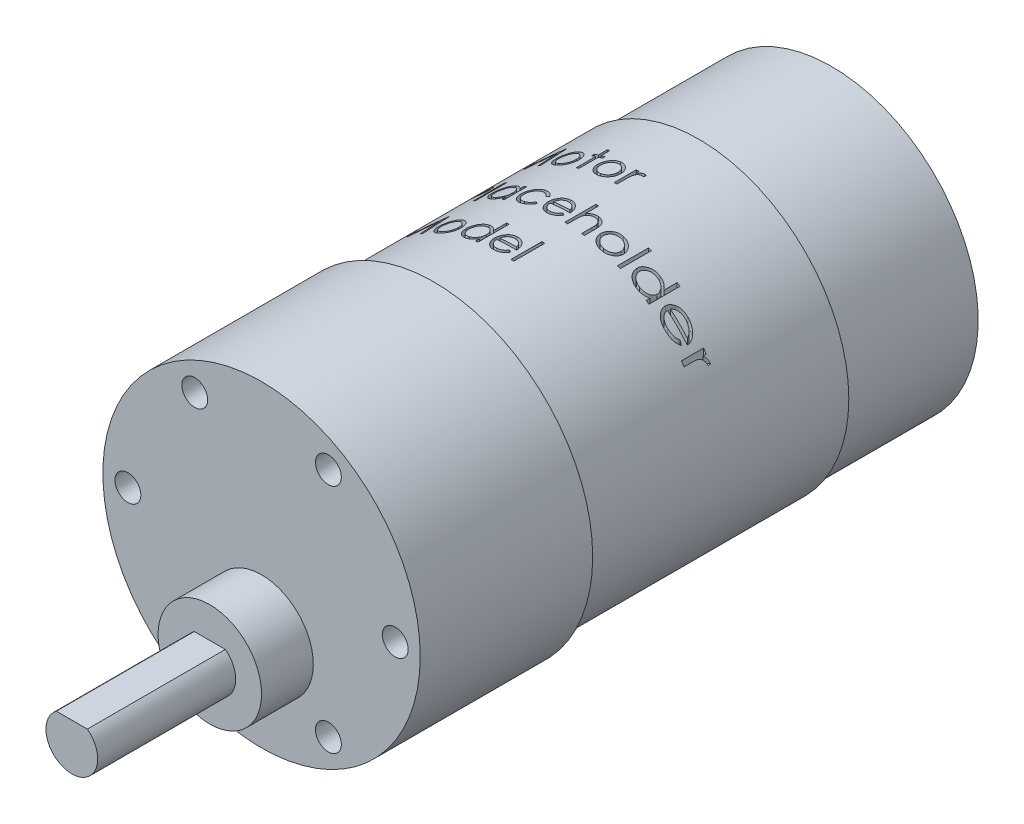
from build123d import *

# Parameters (mm, degrees)
SKETCH1_R           = 17
BOSS_EXTRUDE1_DEPTH = 15.4
SKETCH2_R           = 17.4
BOSS_EXTRUDE2_DEPTH = 30.7
SKETCH3_R           = 18.4
BOSS_EXTRUDE3_DEPTH = 20
SKETCH4_R           = 6
BOSS_EXTRUDE4_DEPTH = 6
SKETCH5_R           = 3
BOSS_EXTRUDE5_DEPTH = 16
SKETCH6_W           = 3.6
SKETCH6_H           = 0.6
CUT_EXTRUDE1_DEPTH  = 16
SKETCH7_R           = 1.5
CUT_EXTRUDE2_DEPTH  = 3
SKETCH8_W           = 0.314102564
SKETCH8_H           = 3.58974359
CUT_EXTRUDE3_DEPTH  = 11


with BuildPart() as part:
    # Sketch1 → Boss-Extrude1 (new body)
    with BuildSketch(Plane.XY):
        with Locations(Location((0, 0, 0), (0, 0, 180))):
            Circle(SKETCH1_R)
    extrude(amount=BOSS_EXTRUDE1_DEPTH)

    # Sketch2 → Boss-Extrude2 (add)
    with BuildSketch(Plane.XY.offset(15.4)):
        Circle(SKETCH2_R)
    extrude(amount=BOSS_EXTRUDE2_DEPTH)

    # Sketch3 → Boss-Extrude3 (add)
    with BuildSketch(Plane.XY.offset(46.1)):
        Circle(SKETCH3_R)
    extrude(amount=BOSS_EXTRUDE3_DEPTH)

    # Sketch4 → Boss-Extrude4 (add)
    with BuildSketch(Plane.XY.offset(66.1)):
        with Locations((0, -7)):
            Circle(SKETCH4_R)
    extrude(amount=BOSS_EXTRUDE4_DEPTH)

    # Sketch5 → Boss-Extrude5 (add)
    with BuildSketch(Plane.XY.offset(72.1)):
        with Locations((0, -7)):
            Circle(SKETCH5_R)
    extrude(amount=BOSS_EXTRUDE5_DEPTH)

    # Sketch6 → Cut-Extrude1 (cut)
    with BuildSketch(Plane.XY.offset(88.1)):
        with Locations((0, -4.3)):
            Rectangle(SKETCH6_W, SKETCH6_H)
    extrude(amount=-CUT_EXTRUDE1_DEPTH, mode=Mode.SUBTRACT)

    # Sketch7 → Cut-Extrude2 (cut)
    with BuildSketch(Plane.XY.offset(66.1)):
        with Locations((7.75, -13.423393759)):
            Circle(SKETCH7_R)
        with Locations((-7.75, -13.423393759)):
            Circle(SKETCH7_R)
        with Locations((-15.5, 0)):
            Circle(SKETCH7_R)
        with Locations((15.5, 0)):
            Circle(SKETCH7_R)
        with Locations((7.75, 13.423393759)):
            Circle(SKETCH7_R)
        with Locations((-7.75, 13.423393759)):
            Circle(SKETCH7_R)
    extrude(amount=-CUT_EXTRUDE2_DEPTH, mode=Mode.SUBTRACT)

    # Sketch8 → Cut-Extrude3 (cut)
    # profile 1 of 21: a face of its own
    with BuildSketch(Plane(origin=(0, 20, 0), x_dir=(1, 0, 0), z_dir=(0, 1, 0))):
        Polygon((-12.975231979, -24.656322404), (-12.513192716, -21.156322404), (-12.468320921, -21.156322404), (-11.023308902, -24.028117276), (-9.582503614, -21.156322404), (-9.537631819, -21.156322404), (-9.071385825, -24.656322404), (-9.385488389, -24.656322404), (-9.722026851, -22.139996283), (-10.984747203, -24.656322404), (-11.056261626, -24.656322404), (-12.324590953, -22.132283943), (-12.659026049, -24.656322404), align=None)
    # profile 2 of 21: a face of its own
    with BuildSketch(Plane(origin=(0, 20, 0), x_dir=(1, 0, 0), z_dir=(0, 1, 0))):
        with BuildLine():
            add(Edge.make_bspline(
                [(-7.207804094, -22.053758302), (-7.159812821, -22.054780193), (-7.065713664, -22.056783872), (-6.927905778, -22.078198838), (-6.796360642, -22.110946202), (-6.67057445, -22.156217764), (-6.552158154, -22.216899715), (-6.43938691, -22.289309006), (-6.332569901, -22.375091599), (-6.268546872, -22.441449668), (-6.236049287, -22.475132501)],
                knots=[0, 0, 0, 0, 1.054011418, 2.066658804, 3.057071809, 4.030435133, 4.997543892, 5.974964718, 6.972108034, 8, 8, 8, 8], degree=3))
            add(Edge.make_bspline(
                [(-6.236049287, -22.475132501), (-6.208067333, -22.507346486), (-6.152644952, -22.571151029), (-6.081579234, -22.674606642), (-6.020357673, -22.781746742), (-5.971294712, -22.893994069), (-5.932609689, -23.01036874), (-5.905143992, -23.131270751), (-5.888807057, -23.256433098), (-5.886604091, -23.341436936), (-5.885488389, -23.384487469)],
                knots=[0, 0, 0, 0, 1.025258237, 2.030674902, 3.01204498, 3.988269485, 4.97094183, 5.956517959, 6.965070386, 8, 8, 8, 8], degree=3))
            add(Edge.make_bspline(
                [(-5.885488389, -23.384487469), (-5.886469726, -23.427787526), (-5.888408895, -23.51335046), (-5.906752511, -23.639369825), (-5.935283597, -23.761564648), (-5.976115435, -23.879423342), (-6.028473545, -23.993306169), (-6.092364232, -24.102715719), (-6.168235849, -24.207867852), (-6.254239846, -24.30786969), (-6.349291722, -24.400035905), (-6.45240787, -24.480364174), (-6.561561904, -24.549185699), (-6.678205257, -24.604622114), (-6.801272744, -24.648331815), (-6.931029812, -24.679031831), (-7.067274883, -24.697593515), (-7.160302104, -24.699977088), (-7.207804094, -24.701194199)],
                knots=[0, 0, 0, 0, 0.998656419, 1.973391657, 2.932242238, 3.890759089, 4.846373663, 5.82037756, 6.809684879, 7.83454468, 8.860553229, 9.859544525, 10.845671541, 11.83227036, 12.833544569, 13.85385346, 14.904124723, 16, 16, 16, 16], degree=3))
            add(Edge.make_bspline(
                [(-7.207804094, -24.701194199), (-7.255538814, -24.699973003), (-7.349029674, -24.697581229), (-7.485755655, -24.679103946), (-7.615745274, -24.648345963), (-7.738973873, -24.604478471), (-7.85611872, -24.549183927), (-7.965905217, -24.480572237), (-8.069105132, -24.400012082), (-8.164177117, -24.307876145), (-8.250175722, -24.207866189), (-8.32604873, -24.10271615), (-8.389939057, -23.993306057), (-8.44229726, -23.879423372), (-8.483129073, -23.76156464), (-8.511660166, -23.639369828), (-8.530003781, -23.513350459), (-8.531942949, -23.427787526), (-8.532924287, -23.384487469)],
                knots=[0, 0, 0, 0, 1.099876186, 2.154163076, 3.173186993, 4.173200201, 5.163417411, 6.152872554, 7.150605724, 8.17532212, 9.198891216, 10.186952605, 11.159729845, 12.11414092, 13.071450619, 14.029093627, 15.002601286, 16, 16, 16, 16], degree=3))
            add(Edge.make_bspline(
                [(-8.532924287, -23.384487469), (-8.531800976, -23.341670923), (-8.529577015, -23.25690152), (-8.513256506, -23.13197446), (-8.485897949, -23.011277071), (-8.447166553, -22.895351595), (-8.397651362, -22.783596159), (-8.337290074, -22.676191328), (-8.265499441, -22.573203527), (-8.21029749, -22.509481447), (-8.182363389, -22.477235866)],
                knots=[0, 0, 0, 0, 1.031353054, 2.041901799, 3.029428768, 4.008703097, 4.981709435, 5.96992636, 6.972712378, 8, 8, 8, 8], degree=3))
            add(Edge.make_bspline(
                [(-8.182363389, -22.477235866), (-8.149914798, -22.443260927), (-8.086098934, -22.376443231), (-7.978750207, -22.290910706), (-7.866256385, -22.216994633), (-7.746531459, -22.157518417), (-7.620848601, -22.110679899), (-7.488629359, -22.078114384), (-7.350353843, -22.056861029), (-7.255794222, -22.054802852), (-7.207804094, -22.053758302)],
                knots=[0, 0, 0, 0, 1.027980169, 2.021703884, 2.998553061, 3.971491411, 4.943284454, 5.930300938, 6.949603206, 8, 8, 8, 8], degree=3))
        make_face()
        with BuildLine():
            add(Edge.make_bspline(
                [(-7.209206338, -22.367860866), (-7.243143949, -22.368825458), (-7.310143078, -22.37072974), (-7.408762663, -22.385213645), (-7.503702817, -22.408161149), (-7.595143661, -22.440765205), (-7.682776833, -22.482864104), (-7.766686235, -22.534572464), (-7.847118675, -22.595205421), (-7.922500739, -22.664668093), (-7.991683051, -22.740547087), (-8.052161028, -22.821395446), (-8.103586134, -22.905901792), (-8.146426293, -22.994154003), (-8.178333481, -23.087046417), (-8.201506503, -23.183527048), (-8.215976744, -23.283792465), (-8.217863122, -23.351953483), (-8.218821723, -23.386590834)],
                knots=[0, 0, 0, 0, 1.021534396, 2.016698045, 2.994645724, 3.958388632, 4.93408049, 5.916473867, 6.921342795, 7.962252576, 8.998418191, 10.008913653, 10.997312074, 11.973003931, 12.956656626, 13.948281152, 14.957379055, 16, 16, 16, 16], degree=3))
            add(Edge.make_bspline(
                [(-8.218821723, -23.386590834), (-8.217214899, -23.431342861), (-8.214025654, -23.520167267), (-8.188090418, -23.650978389), (-8.144704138, -23.776560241), (-8.086116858, -23.896176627), (-8.01271064, -24.006848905), (-7.926223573, -24.10552039), (-7.827583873, -24.190706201), (-7.717967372, -24.261387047), (-7.599613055, -24.317546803), (-7.474356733, -24.357345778), (-7.343716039, -24.383217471), (-7.254435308, -24.385788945), (-7.209206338, -24.387091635)],
                knots=[0, 0, 0, 0, 1.016792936, 2.018143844, 3.017858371, 4.030088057, 5.03801393, 6.028138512, 7.003788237, 7.991172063, 8.984598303, 9.972568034, 10.972917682, 12, 12, 12, 12], degree=3))
            add(Edge.make_bspline(
                [(-7.209206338, -24.387091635), (-7.163979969, -24.385781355), (-7.074704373, -24.383194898), (-6.944245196, -24.357476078), (-6.819331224, -24.317372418), (-6.701099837, -24.261450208), (-6.591533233, -24.190437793), (-6.492184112, -24.106001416), (-6.406435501, -24.006587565), (-6.333101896, -23.896030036), (-6.273555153, -23.776745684), (-6.230371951, -23.650955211), (-6.204374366, -23.52017317), (-6.201193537, -23.431344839), (-6.199590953, -23.386590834)],
                knots=[0, 0, 0, 0, 1.02726834, 2.027799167, 3.010890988, 4.004497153, 4.992059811, 5.971914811, 6.958719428, 7.966827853, 8.981595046, 9.981490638, 10.983022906, 12, 12, 12, 12], degree=3))
            add(Edge.make_bspline(
                [(-6.199590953, -23.386590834), (-6.200549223, -23.351953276), (-6.202434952, -23.283791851), (-6.216909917, -23.183529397), (-6.240065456, -23.0870378), (-6.272037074, -22.994185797), (-6.314691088, -22.905673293), (-6.367107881, -22.821643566), (-6.427338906, -22.74026702), (-6.497356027, -22.664913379), (-6.572659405, -22.595178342), (-6.653124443, -22.534548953), (-6.736909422, -22.483091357), (-6.824288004, -22.440405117), (-6.915740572, -22.408457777), (-7.010547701, -22.385081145), (-7.108746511, -22.370790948), (-7.175505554, -22.368843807), (-7.209206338, -22.367860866)],
                knots=[0, 0, 0, 0, 1.042956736, 2.052379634, 3.044323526, 4.02829302, 5.004299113, 5.996692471, 7.007513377, 8.048758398, 9.090003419, 10.095195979, 11.07790575, 12.047570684, 13.018257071, 13.989683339, 14.985167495, 16, 16, 16, 16], degree=3))
        make_face(mode=Mode.SUBTRACT)
    # profile 3 of 21: a face of its own
    with BuildSketch(Plane(origin=(0, 20, 0), x_dir=(1, 0, 0), z_dir=(0, 1, 0))):
        Polygon((-4.943180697, -21.066578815), (-4.629078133, -21.066578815), (-4.629078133, -22.098630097), (-4.180360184, -22.098630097), (-4.180360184, -22.412732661), (-4.629078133, -22.412732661), (-4.629078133, -24.656322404), (-4.943180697, -24.656322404), (-4.943180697, -22.412732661), (-5.391898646, -22.412732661), (-5.391898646, -22.098630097), (-4.943180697, -22.098630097), align=None)
    # profile 4 of 21: a face of its own
    with BuildSketch(Plane(origin=(0, 20, 0), x_dir=(1, 0, 0), z_dir=(0, 1, 0))):
        with BuildLine():
            add(Edge.make_bspline(
                [(-2.406522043, -22.053758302), (-2.35853077, -22.054780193), (-2.264431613, -22.056783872), (-2.126623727, -22.078198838), (-1.995078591, -22.110946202), (-1.869292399, -22.156217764), (-1.750876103, -22.216899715), (-1.638104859, -22.289309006), (-1.53128785, -22.375091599), (-1.467264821, -22.441449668), (-1.434767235, -22.475132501)],
                knots=[0, 0, 0, 0, 1.054011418, 2.066658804, 3.057071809, 4.030435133, 4.997543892, 5.974964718, 6.972108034, 8, 8, 8, 8], degree=3))
            add(Edge.make_bspline(
                [(-1.434767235, -22.475132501), (-1.406785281, -22.507346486), (-1.351362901, -22.571151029), (-1.280297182, -22.674606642), (-1.219075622, -22.781746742), (-1.170012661, -22.893994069), (-1.131327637, -23.01036874), (-1.103861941, -23.131270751), (-1.087525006, -23.256433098), (-1.085322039, -23.341436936), (-1.084206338, -23.384487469)],
                knots=[0, 0, 0, 0, 1.025258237, 2.030674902, 3.01204498, 3.988269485, 4.97094183, 5.956517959, 6.965070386, 8, 8, 8, 8], degree=3))
            add(Edge.make_bspline(
                [(-1.084206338, -23.384487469), (-1.085187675, -23.427787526), (-1.087126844, -23.51335046), (-1.10547046, -23.639369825), (-1.134001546, -23.761564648), (-1.174833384, -23.879423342), (-1.227191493, -23.993306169), (-1.291082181, -24.102715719), (-1.366953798, -24.207867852), (-1.452957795, -24.30786969), (-1.548009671, -24.400035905), (-1.651125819, -24.480364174), (-1.760279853, -24.549185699), (-1.876923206, -24.604622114), (-1.999990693, -24.648331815), (-2.129747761, -24.679031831), (-2.265992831, -24.697593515), (-2.359020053, -24.699977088), (-2.406522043, -24.701194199)],
                knots=[0, 0, 0, 0, 0.998656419, 1.973391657, 2.932242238, 3.890759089, 4.846373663, 5.82037756, 6.809684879, 7.83454468, 8.860553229, 9.859544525, 10.845671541, 11.83227036, 12.833544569, 13.85385346, 14.904124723, 16, 16, 16, 16], degree=3))
            add(Edge.make_bspline(
                [(-2.406522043, -24.701194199), (-2.454256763, -24.699973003), (-2.547747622, -24.697581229), (-2.684473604, -24.679103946), (-2.814463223, -24.648345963), (-2.937691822, -24.604478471), (-3.054836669, -24.549183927), (-3.164623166, -24.480572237), (-3.267823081, -24.400012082), (-3.362895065, -24.307876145), (-3.448893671, -24.207866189), (-3.524766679, -24.10271615), (-3.588657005, -23.993306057), (-3.641015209, -23.879423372), (-3.681847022, -23.76156464), (-3.710378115, -23.639369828), (-3.728721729, -23.513350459), (-3.730660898, -23.427787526), (-3.731642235, -23.384487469)],
                knots=[0, 0, 0, 0, 1.099876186, 2.154163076, 3.173186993, 4.173200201, 5.163417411, 6.152872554, 7.150605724, 8.17532212, 9.198891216, 10.186952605, 11.159729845, 12.11414092, 13.071450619, 14.029093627, 15.002601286, 16, 16, 16, 16], degree=3))
            add(Edge.make_bspline(
                [(-3.731642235, -23.384487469), (-3.730518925, -23.341670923), (-3.728294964, -23.25690152), (-3.711974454, -23.13197446), (-3.684615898, -23.011277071), (-3.645884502, -22.895351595), (-3.596369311, -22.783596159), (-3.536008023, -22.676191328), (-3.46421739, -22.573203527), (-3.409015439, -22.509481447), (-3.381081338, -22.477235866)],
                knots=[0, 0, 0, 0, 1.031353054, 2.041901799, 3.029428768, 4.008703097, 4.981709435, 5.96992636, 6.972712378, 8, 8, 8, 8], degree=3))
            add(Edge.make_bspline(
                [(-3.381081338, -22.477235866), (-3.348632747, -22.443260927), (-3.284816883, -22.376443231), (-3.177468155, -22.290910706), (-3.064974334, -22.216994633), (-2.945249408, -22.157518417), (-2.81956655, -22.110679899), (-2.687347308, -22.078114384), (-2.549071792, -22.056861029), (-2.454512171, -22.054802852), (-2.406522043, -22.053758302)],
                knots=[0, 0, 0, 0, 1.027980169, 2.021703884, 2.998553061, 3.971491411, 4.943284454, 5.930300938, 6.949603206, 8, 8, 8, 8], degree=3))
        make_face()
        with BuildLine():
            add(Edge.make_bspline(
                [(-2.407924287, -22.367860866), (-2.441861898, -22.368825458), (-2.508861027, -22.37072974), (-2.607480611, -22.385213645), (-2.702420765, -22.408161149), (-2.793861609, -22.440765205), (-2.881494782, -22.482864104), (-2.965404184, -22.534572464), (-3.045836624, -22.595205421), (-3.121218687, -22.664668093), (-3.190401, -22.740547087), (-3.250878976, -22.821395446), (-3.302304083, -22.905901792), (-3.345144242, -22.994154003), (-3.37705143, -23.087046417), (-3.400224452, -23.183527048), (-3.414694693, -23.283792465), (-3.416581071, -23.351953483), (-3.417539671, -23.386590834)],
                knots=[0, 0, 0, 0, 1.021534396, 2.016698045, 2.994645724, 3.958388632, 4.93408049, 5.916473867, 6.921342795, 7.962252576, 8.998418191, 10.008913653, 10.997312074, 11.973003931, 12.956656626, 13.948281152, 14.957379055, 16, 16, 16, 16], degree=3))
            add(Edge.make_bspline(
                [(-3.417539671, -23.386590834), (-3.415932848, -23.431342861), (-3.412743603, -23.520167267), (-3.386808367, -23.650978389), (-3.343422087, -23.776560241), (-3.284834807, -23.896176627), (-3.211428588, -24.006848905), (-3.124941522, -24.10552039), (-3.026301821, -24.190706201), (-2.916685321, -24.261387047), (-2.798331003, -24.317546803), (-2.673074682, -24.357345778), (-2.542433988, -24.383217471), (-2.453153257, -24.385788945), (-2.407924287, -24.387091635)],
                knots=[0, 0, 0, 0, 1.016792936, 2.018143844, 3.017858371, 4.030088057, 5.03801393, 6.028138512, 7.003788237, 7.991172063, 8.984598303, 9.972568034, 10.972917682, 12, 12, 12, 12], degree=3))
            add(Edge.make_bspline(
                [(-2.407924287, -24.387091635), (-2.362697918, -24.385781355), (-2.273422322, -24.383194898), (-2.142963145, -24.357476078), (-2.018049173, -24.317372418), (-1.899817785, -24.261450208), (-1.790251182, -24.190437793), (-1.690902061, -24.106001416), (-1.60515345, -24.006587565), (-1.531819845, -23.896030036), (-1.472273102, -23.776745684), (-1.4290899, -23.650955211), (-1.403092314, -23.52017317), (-1.399911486, -23.431344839), (-1.398308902, -23.386590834)],
                knots=[0, 0, 0, 0, 1.02726834, 2.027799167, 3.010890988, 4.004497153, 4.992059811, 5.971914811, 6.958719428, 7.966827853, 8.981595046, 9.981490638, 10.983022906, 12, 12, 12, 12], degree=3))
            add(Edge.make_bspline(
                [(-1.398308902, -23.386590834), (-1.399267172, -23.351953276), (-1.401152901, -23.283791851), (-1.415627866, -23.183529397), (-1.438783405, -23.0870378), (-1.470755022, -22.994185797), (-1.513409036, -22.905673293), (-1.565825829, -22.821643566), (-1.626056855, -22.74026702), (-1.696073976, -22.664913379), (-1.771377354, -22.595178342), (-1.851842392, -22.534548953), (-1.93562737, -22.483091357), (-2.023005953, -22.440405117), (-2.114458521, -22.408457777), (-2.20926565, -22.385081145), (-2.30746446, -22.370790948), (-2.374223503, -22.368843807), (-2.407924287, -22.367860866)],
                knots=[0, 0, 0, 0, 1.042956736, 2.052379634, 3.044323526, 4.02829302, 5.004299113, 5.996692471, 7.007513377, 8.048758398, 9.090003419, 10.095195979, 11.07790575, 12.047570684, 13.018257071, 13.989683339, 14.985167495, 16, 16, 16, 16], degree=3))
        make_face(mode=Mode.SUBTRACT)
    # profile 5 of 21: a face of its own
    with BuildSketch(Plane(origin=(0, 20, 0), x_dir=(1, 0, 0), z_dir=(0, 1, 0))):
        with BuildLine():
            Line((-0.545744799, -22.098630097), (-0.231642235, -22.098630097))
            Line((-0.231642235, -22.098630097), (-0.231642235, -22.475132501))
            add(Edge.make_bspline(
                [(-0.231642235, -22.475132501), (-0.208453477, -22.440076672), (-0.164105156, -22.373032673), (-0.090392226, -22.284363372), (-0.014888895, -22.210948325), (0.062766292, -22.152444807), (0.143144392, -22.108631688), (0.224481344, -22.076538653), (0.308056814, -22.057561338), (0.364218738, -22.055027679), (0.392356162, -22.053758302)],
                knots=[0, 0, 0, 0, 1.2804753, 2.448899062, 3.506932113, 4.484331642, 5.4025378, 6.288909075, 7.142734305, 8, 8, 8, 8], degree=3))
            add(Edge.make_bspline(
                [(0.392356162, -22.053758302), (0.414182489, -22.054948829), (0.459091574, -22.057398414), (0.527074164, -22.074609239), (0.597117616, -22.102087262), (0.642260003, -22.127927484), (0.665793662, -22.141398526)],
                knots=[0, 0, 0, 0, 0.901110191, 1.854092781, 2.881294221, 4, 4, 4, 4], degree=3))
            Line((0.665793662, -22.141398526), (0.493317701, -22.413433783))
            add(Edge.make_bspline(
                [(0.493317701, -22.413433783), (0.478208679, -22.406693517), (0.449528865, -22.393899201), (0.407574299, -22.378757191), (0.368892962, -22.369841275), (0.344249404, -22.368490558), (0.33276081, -22.367860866)],
                knots=[0, 0, 0, 0, 1.180555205, 2.24091978, 3.179933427, 4, 4, 4, 4], degree=3))
            add(Edge.make_bspline(
                [(0.33276081, -22.367860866), (0.307555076, -22.369540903), (0.256142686, -22.372967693), (0.180658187, -22.3999065), (0.107410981, -22.443431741), (0.049239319, -22.491702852), (0.004197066, -22.53825065), (-0.02794316, -22.578899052), (-0.057425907, -22.624477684), (-0.085596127, -22.674207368), (-0.111262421, -22.728937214), (-0.13521709, -22.788120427), (-0.156875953, -22.851825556), (-0.169226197, -22.896208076), (-0.175552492, -22.918942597)],
                knots=[0, 0, 0, 0, 1.125678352, 2.296057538, 3.5422874, 4.923748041, 5.663163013, 6.437101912, 7.23742474, 8.08941207, 8.991984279, 9.93940061, 10.944477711, 12, 12, 12, 12], degree=3))
            add(Edge.make_bspline(
                [(-0.175552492, -22.918942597), (-0.180284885, -22.93921977), (-0.190766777, -22.984132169), (-0.200958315, -23.059480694), (-0.211027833, -23.148504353), (-0.218124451, -23.251450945), (-0.224702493, -23.368063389), (-0.228412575, -23.498519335), (-0.231515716, -23.642952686), (-0.231598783, -23.743927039), (-0.231642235, -23.796747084)],
                knots=[0, 0, 0, 0, 0.566838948, 1.255505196, 2.06880316, 3.007127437, 4.065329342, 5.249902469, 6.561414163, 8, 8, 8, 8], degree=3))
            Line((-0.231642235, -23.796747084), (-0.231642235, -24.656322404))
            Line((-0.231642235, -24.656322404), (-0.545744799, -24.656322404))
            Line((-0.545744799, -24.656322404), (-0.545744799, -22.098630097))
        make_face()
    # profile 6 of 21: a face of its own
    with BuildSketch(Plane(origin=(0, 20, 0), x_dir=(1, 0, 0), z_dir=(0, 1, 0))):
        with BuildLine():
            Line((-12.795744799, -27.989655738), (-12.109346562, -27.989655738))
            add(Edge.make_bspline(
                [(-12.109346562, -27.989655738), (-12.062135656, -27.989707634), (-11.971677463, -27.98980707), (-11.841962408, -27.992821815), (-11.724152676, -27.996848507), (-11.618502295, -28.002430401), (-11.524686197, -28.009026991), (-11.443128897, -28.01827903), (-11.373189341, -28.027939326), (-11.331282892, -28.037760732), (-11.312171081, -28.042239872)],
                knots=[0, 0, 0, 0, 1.415646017, 2.712440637, 3.8905458, 4.950247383, 5.884950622, 6.709939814, 7.411656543, 8, 8, 8, 8], degree=3))
            add(Edge.make_bspline(
                [(-11.312171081, -28.042239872), (-11.287977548, -28.048861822), (-11.24016057, -28.061949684), (-11.171259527, -28.088163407), (-11.105705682, -28.119245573), (-11.043274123, -28.154669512), (-10.98473204, -28.195955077), (-10.929205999, -28.241428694), (-10.877186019, -28.292140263), (-10.828964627, -28.347521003), (-10.78467983, -28.406641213), (-10.746550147, -28.470383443), (-10.71462292, -28.537674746), (-10.687239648, -28.608468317), (-10.667531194, -28.683358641), (-10.652684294, -28.761825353), (-10.643260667, -28.843860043), (-10.642358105, -28.899919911), (-10.641898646, -28.928457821)],
                knots=[0, 0, 0, 0, 0.999701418, 1.975846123, 2.934577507, 3.890451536, 4.834027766, 5.787354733, 6.749476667, 7.726910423, 8.712836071, 9.690891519, 10.682875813, 11.679750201, 12.712814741, 13.765529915, 14.8625177, 16, 16, 16, 16], degree=3))
            add(Edge.make_bspline(
                [(-10.641898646, -28.928457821), (-10.64232007, -28.957235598), (-10.643144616, -29.013541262), (-10.653040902, -29.09591405), (-10.666371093, -29.17463244), (-10.686868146, -29.249521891), (-10.713713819, -29.320137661), (-10.745205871, -29.387558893), (-10.783189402, -29.450638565), (-10.826834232, -29.509605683), (-10.875385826, -29.564515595), (-10.928638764, -29.614970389), (-10.986378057, -29.660674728), (-11.048420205, -29.701731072), (-11.115370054, -29.737187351), (-11.186212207, -29.768944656), (-11.261562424, -29.795615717), (-11.313704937, -29.809645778), (-11.340215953, -29.816779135)],
                knots=[0, 0, 0, 0, 1.121902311, 2.195077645, 3.232258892, 4.234102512, 5.217864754, 6.176164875, 7.132989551, 8.084763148, 9.034132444, 9.988522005, 10.94243251, 11.903244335, 12.886203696, 13.894208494, 14.929344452, 16, 16, 16, 16], degree=3))
            add(Edge.make_bspline(
                [(-11.340215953, -29.816779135), (-11.362143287, -29.821442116), (-11.410198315, -29.83166131), (-11.489341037, -29.843069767), (-11.581486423, -29.852807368), (-11.686508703, -29.860108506), (-11.804313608, -29.866358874), (-11.934964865, -29.871326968), (-12.078718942, -29.874056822), (-12.178990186, -29.874197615), (-12.231341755, -29.874271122)],
                knots=[0, 0, 0, 0, 0.601384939, 1.31797006, 2.144135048, 3.087295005, 4.142315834, 5.309527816, 6.595305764, 8, 8, 8, 8], degree=3))
            Line((-12.231341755, -29.874271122), (-12.481642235, -29.874271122))
            Line((-12.481642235, -29.874271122), (-12.481642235, -31.489655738))
            Line((-12.481642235, -31.489655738), (-12.795744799, -31.489655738))
            Line((-12.795744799, -31.489655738), (-12.795744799, -27.989655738))
        make_face()
        with BuildLine():
            Line((-12.481642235, -28.348630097), (-12.481642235, -29.515296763))
            Line((-12.481642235, -29.515296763), (-11.868861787, -29.523009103))
            add(Edge.make_bspline(
                [(-11.868861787, -29.523009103), (-11.838941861, -29.523024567), (-11.781182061, -29.523054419), (-11.697745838, -29.519069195), (-11.62033655, -29.514468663), (-11.549191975, -29.507732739), (-11.48428004, -29.498211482), (-11.425492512, -29.488599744), (-11.373285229, -29.474694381), (-11.312186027, -29.455971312), (-11.244102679, -29.424038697), (-11.170035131, -29.377688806), (-11.107264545, -29.318608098), (-11.052946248, -29.252180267), (-11.00984037, -29.178281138), (-10.978284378, -29.099212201), (-10.95974322, -29.015784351), (-10.957257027, -28.958696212), (-10.95600121, -28.929860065)],
                knots=[0, 0, 0, 0, 1.160613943, 2.240541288, 3.23993089, 4.169200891, 5.011653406, 5.7853311, 6.478053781, 7.106038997, 8.262395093, 9.384106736, 10.481365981, 11.59014053, 12.70357646, 13.786202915, 14.881775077, 16, 16, 16, 16], degree=3))
            add(Edge.make_bspline(
                [(-10.95600121, -28.929860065), (-10.957263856, -28.901721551), (-10.959773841, -28.845785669), (-10.978429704, -28.763806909), (-11.009779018, -28.685571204), (-11.053235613, -28.612598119), (-11.105976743, -28.546409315), (-11.167276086, -28.488912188), (-11.236989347, -28.442690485), (-11.301837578, -28.412857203), (-11.359438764, -28.394641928), (-11.409470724, -28.381897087), (-11.465961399, -28.371721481), (-11.528929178, -28.363481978), (-11.597886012, -28.356428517), (-11.673424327, -28.35164254), (-11.75525797, -28.348841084), (-11.812068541, -28.348702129), (-11.841518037, -28.348630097)],
                knots=[0, 0, 0, 0, 1.120700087, 2.227813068, 3.331159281, 4.466773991, 5.599788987, 6.693661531, 7.80175334, 8.91857717, 9.525282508, 10.207424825, 10.974604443, 11.810962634, 12.737642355, 13.736264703, 14.826523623, 16, 16, 16, 16], degree=3))
            Line((-11.841518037, -28.348630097), (-12.481642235, -28.348630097))
        make_face(mode=Mode.SUBTRACT)
    # profile 7 of 21: a face of its own
    with BuildSketch(Plane(origin=(0, 20, 0), x_dir=(1, 0, 0), z_dir=(0, 1, 0))):
        with Locations((-9.90151403, -29.694783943)):
            Rectangle(SKETCH8_W, SKETCH8_H)
    # profile 8 of 21: a face of its own
    with BuildSketch(Plane(origin=(0, 20, 0), x_dir=(1, 0, 0), z_dir=(0, 1, 0))):
        with BuildLine():
            Line((-6.423949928, -28.93196343), (-6.423949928, -31.489655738))
            Line((-6.423949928, -31.489655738), (-6.738052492, -31.489655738))
            Line((-6.738052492, -31.489655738), (-6.738052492, -31.047247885))
            add(Edge.make_bspline(
                [(-6.738052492, -31.047247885), (-6.773471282, -31.087287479), (-6.842591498, -31.16542525), (-6.958032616, -31.267507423), (-7.080400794, -31.351885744), (-7.209102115, -31.42003566), (-7.344020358, -31.471227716), (-7.484856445, -31.507613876), (-7.631667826, -31.531007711), (-7.731920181, -31.533343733), (-7.782723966, -31.534527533)],
                knots=[0, 0, 0, 0, 1.074387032, 2.096679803, 3.090159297, 4.057316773, 5.018401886, 5.985159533, 6.978961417, 8, 8, 8, 8], degree=3))
            add(Edge.make_bspline(
                [(-7.782723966, -31.534527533), (-7.82789192, -31.53330116), (-7.916965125, -31.5308827), (-8.047994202, -31.512120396), (-8.174086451, -31.481989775), (-8.295361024, -31.440088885), (-8.41103317, -31.384508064), (-8.522093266, -31.317966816), (-8.627965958, -31.238725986), (-8.727037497, -31.148137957), (-8.818269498, -31.04974297), (-8.89833077, -30.944797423), (-8.96508385, -30.833755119), (-9.020903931, -30.718021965), (-9.063900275, -30.596707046), (-9.093873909, -30.470229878), (-9.112614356, -30.338740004), (-9.115031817, -30.249200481), (-9.11625762, -30.203798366)],
                knots=[0, 0, 0, 0, 1.033919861, 2.038935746, 3.024066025, 3.998881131, 4.97069526, 5.957263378, 6.95902576, 7.993208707, 9.027059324, 10.027763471, 11.009749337, 11.988697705, 12.965288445, 13.950418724, 14.960734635, 16, 16, 16, 16], degree=3))
            add(Edge.make_bspline(
                [(-9.11625762, -30.203798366), (-9.115004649, -30.159334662), (-9.112527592, -30.071432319), (-9.094074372, -29.942153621), (-9.063043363, -29.81763536), (-9.019495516, -29.698278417), (-8.963653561, -29.583938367), (-8.895725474, -29.474534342), (-8.815706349, -29.369764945), (-8.723453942, -29.272093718), (-8.623519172, -29.181873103), (-8.516610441, -29.103464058), (-8.405387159, -29.035747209), (-8.288124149, -28.982093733), (-8.166557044, -28.938684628), (-8.039603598, -28.90865166), (-7.90779202, -28.890954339), (-7.818301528, -28.888391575), (-7.772908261, -28.887091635)],
                knots=[0, 0, 0, 0, 1.020392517, 2.01726096, 2.990465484, 3.961182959, 4.928053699, 5.906110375, 6.912531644, 7.948652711, 8.985773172, 9.998621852, 10.987621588, 11.969261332, 12.953316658, 13.946091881, 14.958173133, 16, 16, 16, 16], degree=3))
            add(Edge.make_bspline(
                [(-7.772908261, -28.887091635), (-7.720708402, -28.888529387), (-7.618346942, -28.89134875), (-7.468618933, -28.914811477), (-7.326974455, -28.954449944), (-7.192320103, -29.008367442), (-7.065139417, -29.080016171), (-6.946636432, -29.170396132), (-6.835570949, -29.278937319), (-6.771190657, -29.362307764), (-6.738052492, -29.405220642)],
                knots=[0, 0, 0, 0, 1.038897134, 2.037228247, 3.008116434, 3.962042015, 4.918381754, 5.904844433, 6.921570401, 8, 8, 8, 8], degree=3))
            Line((-6.738052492, -29.405220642), (-6.738052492, -28.93196343))
            Line((-6.738052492, -28.93196343), (-6.423949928, -28.93196343))
        make_face()
        with BuildLine():
            add(Edge.make_bspline(
                [(-7.76870153, -29.201194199), (-7.814615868, -29.202827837), (-7.905243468, -29.206052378), (-8.03828747, -29.231225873), (-8.165600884, -29.273110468), (-8.286546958, -29.330392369), (-8.399215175, -29.402421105), (-8.499908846, -29.489542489), (-8.589451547, -29.589379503), (-8.664759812, -29.701481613), (-8.726150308, -29.821659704), (-8.76931734, -29.947284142), (-8.797786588, -30.07608912), (-8.800695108, -30.163451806), (-8.802155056, -30.207303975)],
                knots=[0, 0, 0, 0, 1.031046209, 2.035121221, 3.029706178, 4.034933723, 5.034054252, 6.02443088, 7.017295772, 8.038157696, 9.050218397, 10.03989886, 11.016116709, 12, 12, 12, 12], degree=3))
            add(Edge.make_bspline(
                [(-8.802155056, -30.207303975), (-8.800290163, -30.250894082), (-8.796567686, -30.337903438), (-8.769816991, -30.466884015), (-8.724937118, -30.592538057), (-8.663695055, -30.71379905), (-8.58700843, -30.826383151), (-8.498119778, -30.928123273), (-8.396169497, -31.015612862), (-8.283241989, -31.088850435), (-8.162634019, -31.148012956), (-8.035800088, -31.189178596), (-7.905124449, -31.215756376), (-7.816272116, -31.218860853), (-7.771506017, -31.220424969)],
                knots=[0, 0, 0, 0, 0.979072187, 1.954306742, 2.945804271, 3.96968567, 4.997920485, 5.998718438, 6.996577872, 8.005894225, 9.015743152, 10.005417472, 10.995077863, 12, 12, 12, 12], degree=3))
            add(Edge.make_bspline(
                [(-7.771506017, -31.220424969), (-7.726059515, -31.218765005), (-7.635670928, -31.215463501), (-7.50223222, -31.190182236), (-7.372737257, -31.148413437), (-7.248950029, -31.090514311), (-7.133633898, -31.018756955), (-7.03013602, -30.934749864), (-6.942620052, -30.83704668), (-6.868427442, -30.729670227), (-6.810252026, -30.61195823), (-6.767875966, -30.486624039), (-6.742822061, -30.353663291), (-6.739664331, -30.262799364), (-6.738052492, -30.216418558)],
                knots=[0, 0, 0, 0, 1.01762866, 2.023962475, 3.030623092, 4.058876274, 5.077231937, 6.066672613, 7.034107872, 8.005628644, 8.981990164, 9.965428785, 10.961468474, 12, 12, 12, 12], degree=3))
            add(Edge.make_bspline(
                [(-6.738052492, -30.216418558), (-6.739012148, -30.181080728), (-6.740901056, -30.111524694), (-6.755331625, -30.009397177), (-6.778286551, -29.911663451), (-6.810632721, -29.818220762), (-6.853124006, -29.729585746), (-6.904371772, -29.645121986), (-6.965277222, -29.565268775), (-7.034859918, -29.491125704), (-7.11102512, -29.423499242), (-7.191619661, -29.363135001), (-7.277598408, -29.313546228), (-7.367515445, -29.272504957), (-7.461526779, -29.239845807), (-7.560397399, -29.218058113), (-7.663076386, -29.203097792), (-7.733122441, -29.201835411), (-7.76870153, -29.201194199)],
                knots=[0, 0, 0, 0, 1.050140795, 2.067009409, 3.05949893, 4.030605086, 5.00011959, 5.97591094, 6.962425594, 7.979863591, 8.993523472, 9.986985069, 10.967611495, 11.937549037, 12.921786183, 13.919465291, 14.943216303, 16, 16, 16, 16], degree=3))
        make_face(mode=Mode.SUBTRACT)
    # profile 9 of 21: a face of its own
    with BuildSketch(Plane(origin=(0, 20, 0), x_dir=(1, 0, 0), z_dir=(0, 1, 0))):
        with BuildLine():
            Line((-3.193180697, -29.48655077), (-3.45610137, -29.649912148))
            add(Edge.make_bspline(
                [(-3.45610137, -29.649912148), (-3.484931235, -29.614083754), (-3.541677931, -29.543561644), (-3.640217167, -29.452551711), (-3.745228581, -29.374384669), (-3.858506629, -29.310680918), (-3.979892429, -29.261459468), (-4.10890728, -29.226629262), (-4.245532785, -29.204925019), (-4.339197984, -29.202458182), (-4.387191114, -29.201194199)],
                knots=[0, 0, 0, 0, 1.026593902, 2.0206758, 2.988051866, 3.946915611, 4.916868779, 5.907761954, 6.927957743, 8, 8, 8, 8], degree=3))
            add(Edge.make_bspline(
                [(-4.387191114, -29.201194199), (-4.42555007, -29.202251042), (-4.501096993, -29.204332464), (-4.612003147, -29.217342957), (-4.7176455, -29.240984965), (-4.818686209, -29.272135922), (-4.914406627, -29.313886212), (-5.005057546, -29.364695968), (-5.091443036, -29.423746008), (-5.171059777, -29.492156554), (-5.243888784, -29.566555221), (-5.306987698, -29.646308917), (-5.361924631, -29.729028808), (-5.405030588, -29.81678055), (-5.440305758, -29.907556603), (-5.463512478, -30.003070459), (-5.478977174, -30.102098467), (-5.480746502, -30.169616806), (-5.481642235, -30.203798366)],
                knots=[0, 0, 0, 0, 1.112346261, 2.190735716, 3.231507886, 4.247384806, 5.251966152, 6.253067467, 7.256802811, 8.280671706, 9.291813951, 10.270744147, 11.225547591, 12.165006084, 13.100104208, 14.043489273, 15.009504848, 16, 16, 16, 16], degree=3))
            add(Edge.make_bspline(
                [(-5.481642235, -30.203798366), (-5.479862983, -30.248567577), (-5.476328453, -30.337502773), (-5.448626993, -30.468780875), (-5.403282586, -30.595704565), (-5.341224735, -30.717372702), (-5.2627476, -30.829966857), (-5.170575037, -30.930950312), (-5.064655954, -31.01836634), (-4.945923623, -31.090838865), (-4.81716588, -31.149100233), (-4.679775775, -31.190607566), (-4.534875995, -31.215659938), (-4.435669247, -31.218815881), (-4.385087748, -31.220424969)],
                knots=[0, 0, 0, 0, 0.966302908, 1.919585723, 2.883856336, 3.870342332, 4.860282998, 5.839159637, 6.814385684, 7.815993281, 8.834850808, 9.858348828, 10.908058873, 12, 12, 12, 12], degree=3))
            add(Edge.make_bspline(
                [(-4.385087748, -31.220424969), (-4.338732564, -31.219125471), (-4.247632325, -31.216571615), (-4.11446504, -31.195042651), (-3.987685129, -31.159799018), (-3.867297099, -31.110651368), (-3.753520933, -31.047123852), (-3.647091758, -30.968764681), (-3.54589182, -30.877828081), (-3.486394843, -30.807510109), (-3.45610137, -30.77170702)],
                knots=[0, 0, 0, 0, 1.039848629, 2.043578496, 3.018386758, 3.987534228, 4.954977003, 5.934852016, 6.948509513, 8, 8, 8, 8], degree=3))
            Line((-3.45610137, -30.77170702), (-3.193180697, -30.944182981))
            add(Edge.make_bspline(
                [(-3.193180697, -30.944182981), (-3.208768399, -30.967073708), (-3.239892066, -31.012779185), (-3.291919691, -31.077223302), (-3.348039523, -31.137544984), (-3.40803262, -31.193663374), (-3.47111563, -31.246921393), (-3.539443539, -31.294772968), (-3.610813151, -31.339907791), (-3.686062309, -31.380520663), (-3.764413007, -31.417026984), (-3.845754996, -31.448418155), (-3.929734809, -31.475388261), (-4.016451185, -31.496825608), (-4.106075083, -31.513936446), (-4.198374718, -31.525290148), (-4.293318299, -31.533765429), (-4.357490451, -31.534271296), (-4.389995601, -31.534527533)],
                knots=[0, 0, 0, 0, 0.954134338, 1.905101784, 2.851144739, 3.791306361, 4.734911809, 5.6936923, 6.663572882, 7.643865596, 8.638447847, 9.640600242, 10.646758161, 11.676244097, 12.717260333, 13.78922464, 14.880174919, 16, 16, 16, 16], degree=3))
            add(Edge.make_bspline(
                [(-4.389995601, -31.534527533), (-4.439606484, -31.533636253), (-4.536844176, -31.531889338), (-4.679166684, -31.512680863), (-4.815180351, -31.483723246), (-4.944838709, -31.442159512), (-5.068161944, -31.388654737), (-5.185035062, -31.323297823), (-5.29507108, -31.245546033), (-5.397181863, -31.156783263), (-5.490963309, -31.060542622), (-5.571489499, -30.956692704), (-5.64133477, -30.849051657), (-5.697422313, -30.735242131), (-5.742069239, -30.616776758), (-5.772574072, -30.492706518), (-5.79230381, -30.364054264), (-5.794587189, -30.276321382), (-5.795744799, -30.231843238)],
                knots=[0, 0, 0, 0, 1.1129367, 2.181364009, 3.217532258, 4.231199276, 5.232079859, 6.230262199, 7.231623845, 8.250719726, 9.263571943, 10.242672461, 11.195837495, 12.138959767, 13.085126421, 14.0317438, 15.002148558, 16, 16, 16, 16], degree=3))
            add(Edge.make_bspline(
                [(-5.795744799, -30.231843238), (-5.795303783, -30.201664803), (-5.794426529, -30.141634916), (-5.784364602, -30.052539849), (-5.771366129, -29.964631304), (-5.749340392, -29.879023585), (-5.72389976, -29.794418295), (-5.691424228, -29.711835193), (-5.653328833, -29.63089052), (-5.610076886, -29.551792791), (-5.561388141, -29.475843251), (-5.507506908, -29.404089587), (-5.450462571, -29.335669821), (-5.387586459, -29.27294606), (-5.321546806, -29.213409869), (-5.25047523, -29.158651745), (-5.174779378, -29.108510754), (-5.095596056, -29.062059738), (-5.012971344, -29.020700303), (-4.927404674, -28.985067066), (-4.839411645, -28.95461449), (-4.7488515, -28.93050557), (-4.656325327, -28.910288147), (-4.561103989, -28.897570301), (-4.463551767, -28.888584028), (-4.397495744, -28.887593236), (-4.364054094, -28.887091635)],
                knots=[0, 0, 0, 0, 0.990994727, 1.971252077, 2.943264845, 3.907940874, 4.872158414, 5.844625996, 6.82015047, 7.809835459, 8.804511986, 9.781214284, 10.756496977, 11.728388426, 12.696359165, 13.676225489, 14.672885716, 15.677705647, 16.690706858, 17.706033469, 18.721040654, 19.747369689, 20.783475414, 21.830280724, 22.901553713, 24, 24, 24, 24], degree=3))
            add(Edge.make_bspline(
                [(-4.364054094, -28.887091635), (-4.322173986, -28.888013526), (-4.238623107, -28.8898527), (-4.1146824, -28.905331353), (-3.992567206, -28.928667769), (-3.874420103, -28.963240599), (-3.761673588, -29.005104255), (-3.656138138, -29.052116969), (-3.560298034, -29.106711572), (-3.472370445, -29.166431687), (-3.392190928, -29.233792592), (-3.318936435, -29.30959955), (-3.251104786, -29.393458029), (-3.212648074, -29.45526376), (-3.193180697, -29.48655077)],
                knots=[0, 0, 0, 0, 1.095225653, 2.184976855, 3.262915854, 4.344593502, 5.400796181, 6.407717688, 7.363229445, 8.282371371, 9.184954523, 10.097238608, 11.036792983, 12, 12, 12, 12], degree=3))
        make_face()
    # profile 10 of 21: a face of its own
    with BuildSketch(Plane(origin=(0, 20, 0), x_dir=(1, 0, 0), z_dir=(0, 1, 0))):
        with BuildLine():
            Line((-0.465816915, -30.68196343), (-0.18677044, -30.828497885))
            add(Edge.make_bspline(
                [(-0.18677044, -30.828497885), (-0.209007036, -30.867941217), (-0.252270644, -30.944682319), (-0.326671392, -31.05011418), (-0.404663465, -31.144961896), (-0.489767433, -31.22669155), (-0.579437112, -31.297942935), (-0.674169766, -31.36028076), (-0.774458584, -31.41339928), (-0.880308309, -31.458151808), (-0.99260786, -31.492561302), (-1.111629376, -31.516865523), (-1.237600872, -31.531888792), (-1.323947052, -31.533633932), (-1.368160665, -31.534527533)],
                knots=[0, 0, 0, 0, 1.120438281, 2.179929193, 3.190490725, 4.156257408, 5.095198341, 6.022838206, 6.959905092, 7.901321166, 8.864066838, 9.862729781, 10.905609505, 12, 12, 12, 12], degree=3))
            add(Edge.make_bspline(
                [(-1.368160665, -31.534527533), (-1.417302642, -31.533380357), (-1.513164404, -31.531142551), (-1.652704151, -31.511850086), (-1.78408357, -31.480377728), (-1.907295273, -31.436412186), (-2.022037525, -31.378984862), (-2.12853838, -31.30902538), (-2.227357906, -31.226893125), (-2.315382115, -31.131876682), (-2.394625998, -31.030194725), (-2.464551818, -30.92423884), (-2.523009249, -30.814275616), (-2.570561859, -30.701005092), (-2.608966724, -30.585141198), (-2.635733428, -30.465629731), (-2.651163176, -30.342794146), (-2.653527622, -30.259696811), (-2.654719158, -30.217820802)],
                knots=[0, 0, 0, 0, 1.145258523, 2.234067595, 3.276747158, 4.290159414, 5.277019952, 6.260822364, 7.254936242, 8.264827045, 9.274100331, 10.257902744, 11.220704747, 12.172965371, 13.118907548, 14.062713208, 15.023725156, 16, 16, 16, 16], degree=3))
            add(Edge.make_bspline(
                [(-2.654719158, -30.217820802), (-2.653660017, -30.178525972), (-2.651560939, -30.100648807), (-2.638330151, -29.985383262), (-2.614881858, -29.87335481), (-2.582705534, -29.764470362), (-2.541154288, -29.658912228), (-2.490322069, -29.556616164), (-2.430129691, -29.457691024), (-2.383657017, -29.395287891), (-2.360248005, -29.363854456)],
                knots=[0, 0, 0, 0, 1.024358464, 2.0301432, 3.019427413, 4.004406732, 4.986367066, 5.972626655, 6.978780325, 8, 8, 8, 8], degree=3))
            add(Edge.make_bspline(
                [(-2.360248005, -29.363854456), (-2.328540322, -29.325985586), (-2.266129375, -29.251447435), (-2.16057302, -29.153509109), (-2.046272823, -29.071465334), (-1.924661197, -29.003458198), (-1.794324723, -28.951784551), (-1.657015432, -28.913276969), (-1.511169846, -28.891698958), (-1.411464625, -28.888651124), (-1.360448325, -28.887091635)],
                knots=[0, 0, 0, 0, 1.030682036, 2.02871468, 2.997146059, 3.962720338, 4.930598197, 5.918074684, 6.934738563, 8, 8, 8, 8], degree=3))
            add(Edge.make_bspline(
                [(-1.360448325, -28.887091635), (-1.30800072, -28.888445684), (-1.205110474, -28.891102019), (-1.055078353, -28.915728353), (-0.913117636, -28.954780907), (-0.779285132, -29.009934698), (-0.653567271, -29.08109425), (-0.536781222, -29.169236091), (-0.426929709, -29.271654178), (-0.36302113, -29.350417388), (-0.330500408, -29.390497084)],
                knots=[0, 0, 0, 0, 1.056321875, 2.072262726, 3.055038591, 4.01806755, 4.982017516, 5.957941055, 6.960871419, 8, 8, 8, 8], degree=3))
            add(Edge.make_bspline(
                [(-0.330500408, -29.390497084), (-0.30837347, -29.420700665), (-0.264266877, -29.480906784), (-0.209019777, -29.579077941), (-0.161062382, -29.681788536), (-0.122729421, -29.790698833), (-0.09168992, -29.904518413), (-0.069233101, -30.024060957), (-0.056063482, -30.149290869), (-0.053474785, -30.234617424), (-0.052155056, -30.278117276)],
                knots=[0, 0, 0, 0, 0.94817472, 1.890038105, 2.849395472, 3.817997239, 4.812318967, 5.836947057, 6.897266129, 8, 8, 8, 8], degree=3))
            Line((-0.052155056, -30.278117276), (-2.340616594, -30.278117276))
            add(Edge.make_bspline(
                [(-2.340616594, -30.278117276), (-2.339076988, -30.311817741), (-2.336049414, -30.378088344), (-2.321934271, -30.475059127), (-2.299685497, -30.56743247), (-2.268416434, -30.654515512), (-2.230549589, -30.737445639), (-2.184163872, -30.815607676), (-2.128824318, -30.888645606), (-2.067098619, -30.957212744), (-1.998391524, -31.018273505), (-1.926108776, -31.072925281), (-1.849215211, -31.118730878), (-1.768317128, -31.155910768), (-1.683545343, -31.185017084), (-1.594873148, -31.204884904), (-1.502475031, -31.218192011), (-1.439489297, -31.219671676), (-1.407423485, -31.220424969)],
                knots=[0, 0, 0, 0, 1.094153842, 2.151609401, 3.174256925, 4.172055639, 5.149267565, 6.128595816, 7.11444997, 8.118368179, 9.117203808, 10.09244225, 11.054858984, 12.015122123, 12.976791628, 13.957293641, 14.960065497, 16, 16, 16, 16], degree=3))
            add(Edge.make_bspline(
                [(-1.407423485, -31.220424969), (-1.376072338, -31.219816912), (-1.313865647, -31.218610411), (-1.221224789, -31.2068785), (-1.130085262, -31.187908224), (-1.040824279, -31.162018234), (-0.955253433, -31.130441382), (-0.876007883, -31.092338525), (-0.803127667, -31.050188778), (-0.735010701, -31.001979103), (-0.668939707, -30.942970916), (-0.603397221, -30.869335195), (-0.533120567, -30.782247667), (-0.489130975, -30.716702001), (-0.465816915, -30.68196343)],
                knots=[0, 0, 0, 0, 0.99110716, 1.966546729, 2.947904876, 3.932708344, 4.903319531, 5.828989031, 6.710028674, 7.56322171, 8.463672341, 9.504779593, 10.677557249, 12, 12, 12, 12], degree=3))
        make_face()
        with BuildLine():
            add(Edge.make_bspline(
                [(-0.36625762, -29.964014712), (-0.377754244, -29.922351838), (-0.399881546, -29.842164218), (-0.44611791, -29.731123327), (-0.498189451, -29.632435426), (-0.559811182, -29.546855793), (-0.629629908, -29.47085228), (-0.710275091, -29.404433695), (-0.800710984, -29.345016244), (-0.900470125, -29.294863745), (-1.00611191, -29.252173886), (-1.116718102, -29.22354877), (-1.22957589, -29.203939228), (-1.305910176, -29.202113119), (-1.344322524, -29.201194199)],
                knots=[0, 0, 0, 0, 1.154881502, 2.222775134, 3.210006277, 4.132804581, 5.035138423, 5.962687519, 6.919655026, 7.923214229, 8.944639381, 9.960483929, 10.97369054, 12, 12, 12, 12], degree=3))
            add(Edge.make_bspline(
                [(-1.344322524, -29.201194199), (-1.375671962, -29.201805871), (-1.437643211, -29.203015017), (-1.52894428, -29.214485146), (-1.616623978, -29.233444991), (-1.701329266, -29.259409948), (-1.781950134, -29.29401855), (-1.860144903, -29.334601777), (-1.933925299, -29.384143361), (-1.980066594, -29.421902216), (-2.003377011, -29.440977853)],
                knots=[0, 0, 0, 0, 1.04873581, 2.073130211, 3.073294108, 4.04793562, 5.032784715, 6.005352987, 6.992311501, 8, 8, 8, 8], degree=3))
            add(Edge.make_bspline(
                [(-2.003377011, -29.440977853), (-2.020070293, -29.456072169), (-2.053853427, -29.486619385), (-2.098993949, -29.539248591), (-2.142214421, -29.596000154), (-2.181548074, -29.659045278), (-2.217625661, -29.727666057), (-2.251385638, -29.801283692), (-2.28177205, -29.880456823), (-2.29886816, -29.935629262), (-2.30766387, -29.964014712)],
                knots=[0, 0, 0, 0, 0.879870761, 1.780643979, 2.707998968, 3.669668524, 4.684282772, 5.740141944, 6.837334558, 8, 8, 8, 8], degree=3))
            Line((-2.30766387, -29.964014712), (-0.36625762, -29.964014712))
        make_face(mode=Mode.SUBTRACT)
    # profile 11 of 21: a face of its own
    with BuildSketch(Plane(origin=(0, 20, 0), x_dir=(1, 0, 0), z_dir=(0, 1, 0))):
        with BuildLine():
            Line((0.576050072, -27.899912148), (0.890152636, -27.899912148))
            Line((0.890152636, -27.899912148), (0.890152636, -29.415036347))
            add(Edge.make_bspline(
                [(0.890152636, -29.415036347), (0.923869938, -29.372892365), (0.989519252, -29.290835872), (1.100015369, -29.183774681), (1.213486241, -29.09097606), (1.333851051, -29.017105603), (1.458901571, -28.958749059), (1.589165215, -28.917361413), (1.724666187, -28.891910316), (1.816691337, -28.888711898), (1.863309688, -28.887091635)],
                knots=[0, 0, 0, 0, 1.125788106, 2.19196713, 3.20547328, 4.180437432, 5.132270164, 6.079753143, 7.027236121, 8, 8, 8, 8], degree=3))
            add(Edge.make_bspline(
                [(1.863309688, -28.887091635), (1.910640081, -28.888837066), (2.003277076, -28.892253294), (2.138158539, -28.919266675), (2.264119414, -28.965424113), (2.380785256, -29.028591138), (2.485609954, -29.107263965), (2.578459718, -29.198095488), (2.654300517, -29.303369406), (2.705899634, -29.40062566), (2.739473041, -29.487164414), (2.760724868, -29.561400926), (2.778744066, -29.644122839), (2.794443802, -29.735287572), (2.804907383, -29.835332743), (2.813312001, -29.943806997), (2.819288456, -30.060704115), (2.81952006, -30.141624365), (2.819639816, -30.183465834)],
                knots=[0, 0, 0, 0, 1.235656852, 2.418478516, 3.575258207, 4.727955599, 5.870717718, 6.98870536, 8.107142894, 9.245821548, 9.854588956, 10.528768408, 11.260415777, 12.065282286, 12.943670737, 13.886611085, 14.907229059, 16, 16, 16, 16], degree=3))
            Line((2.819639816, -30.183465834), (2.819639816, -31.489655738))
            Line((2.819639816, -31.489655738), (2.505537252, -31.489655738))
            Line((2.505537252, -31.489655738), (2.505537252, -30.286530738))
            add(Edge.make_bspline(
                [(2.505537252, -30.286530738), (2.505346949, -30.251708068), (2.504982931, -30.185098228), (2.503779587, -30.08973212), (2.501093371, -30.003235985), (2.496752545, -29.925887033), (2.492187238, -29.85757743), (2.485903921, -29.798406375), (2.478593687, -29.7482926), (2.472024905, -29.718127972), (2.469078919, -29.704599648)],
                knots=[0, 0, 0, 0, 1.430932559, 2.737130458, 3.918967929, 4.986496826, 5.920444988, 6.731744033, 7.431208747, 8, 8, 8, 8], degree=3))
            add(Edge.make_bspline(
                [(2.469078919, -29.704599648), (2.457654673, -29.664905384), (2.435691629, -29.588593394), (2.384643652, -29.484930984), (2.320884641, -29.396546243), (2.243037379, -29.324631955), (2.152479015, -29.268220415), (2.048619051, -29.229152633), (1.932434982, -29.204904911), (1.850583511, -29.202465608), (1.807921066, -29.201194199)],
                knots=[0, 0, 0, 0, 1.090059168, 2.095632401, 3.037101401, 3.955032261, 4.878929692, 5.839099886, 6.873700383, 8, 8, 8, 8], degree=3))
            add(Edge.make_bspline(
                [(1.807921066, -29.201194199), (1.782653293, -29.201670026), (1.732649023, -29.202611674), (1.658500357, -29.212065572), (1.586571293, -29.227514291), (1.516169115, -29.24841883), (1.448785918, -29.276864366), (1.382457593, -29.309794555), (1.319063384, -29.35010281), (1.257477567, -29.395328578), (1.200160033, -29.445398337), (1.146832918, -29.498245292), (1.099294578, -29.554520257), (1.056225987, -29.613320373), (1.019047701, -29.675452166), (0.986594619, -29.740316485), (0.959058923, -29.80799863), (0.94537623, -29.854973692), (0.93853004, -29.878477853)],
                knots=[0, 0, 0, 0, 1.024319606, 2.027102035, 3.025350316, 4.005802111, 5.00026367, 5.987881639, 7.005602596, 8.042517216, 9.083927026, 10.089214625, 11.084353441, 12.06828073, 13.041928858, 14.016821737, 15.00770877, 16, 16, 16, 16], degree=3))
            add(Edge.make_bspline(
                [(0.93853004, -29.878477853), (0.934590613, -29.895498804), (0.926006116, -29.932589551), (0.916691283, -29.993763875), (0.908353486, -30.064850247), (0.901304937, -30.145740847), (0.89698185, -30.23673209), (0.892323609, -30.337203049), (0.890589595, -30.44778307), (0.890302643, -30.524678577), (0.890152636, -30.56487609)],
                knots=[0, 0, 0, 0, 0.607992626, 1.324890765, 2.152360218, 3.099583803, 4.150613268, 5.323148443, 6.60066238, 8, 8, 8, 8], degree=3))
            Line((0.890152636, -30.56487609), (0.890152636, -31.489655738))
            Line((0.890152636, -31.489655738), (0.576050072, -31.489655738))
            Line((0.576050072, -31.489655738), (0.576050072, -27.899912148))
        make_face()
    # profile 12 of 21: a face of its own
    with BuildSketch(Plane(origin=(0, 20, 0), x_dir=(1, 0, 0), z_dir=(0, 1, 0))):
        with BuildLine():
            add(Edge.make_bspline(
                [(4.772965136, -28.887091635), (4.820956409, -28.888113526), (4.915055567, -28.890117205), (5.052863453, -28.911532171), (5.184408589, -28.944279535), (5.310194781, -28.989551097), (5.428611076, -29.050233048), (5.54138232, -29.122642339), (5.648199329, -29.208424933), (5.712222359, -29.274783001), (5.744719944, -29.308465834)],
                knots=[0, 0, 0, 0, 1.054011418, 2.066658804, 3.057071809, 4.030435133, 4.997543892, 5.974964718, 6.972108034, 8, 8, 8, 8], degree=3))
            add(Edge.make_bspline(
                [(5.744719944, -29.308465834), (5.772701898, -29.34067982), (5.828124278, -29.404484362), (5.899189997, -29.507939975), (5.960411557, -29.615080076), (6.009474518, -29.727327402), (6.048159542, -29.843702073), (6.075625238, -29.964604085), (6.091962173, -30.089766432), (6.09416514, -30.17477027), (6.095280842, -30.217820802)],
                knots=[0, 0, 0, 0, 1.025258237, 2.030674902, 3.01204498, 3.988269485, 4.97094183, 5.956517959, 6.965070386, 8, 8, 8, 8], degree=3))
            add(Edge.make_bspline(
                [(6.095280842, -30.217820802), (6.094299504, -30.26112086), (6.092360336, -30.346683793), (6.07401672, -30.472703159), (6.045485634, -30.594897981), (6.004653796, -30.712756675), (5.952295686, -30.826639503), (5.888404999, -30.936049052), (5.812533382, -31.041201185), (5.726529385, -31.141203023), (5.631477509, -31.233369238), (5.52836136, -31.313697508), (5.419207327, -31.382519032), (5.302563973, -31.437955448), (5.179496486, -31.481665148), (5.049739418, -31.512365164), (4.913494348, -31.530926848), (4.820467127, -31.533310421), (4.772965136, -31.534527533)],
                knots=[0, 0, 0, 0, 0.998656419, 1.973391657, 2.932242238, 3.890759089, 4.846373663, 5.82037756, 6.809684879, 7.83454468, 8.860553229, 9.859544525, 10.845671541, 11.83227036, 12.833544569, 13.85385346, 14.904124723, 16, 16, 16, 16], degree=3))
            add(Edge.make_bspline(
                [(4.772965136, -31.534527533), (4.725230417, -31.533306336), (4.631739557, -31.530914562), (4.495013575, -31.512437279), (4.365023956, -31.481679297), (4.241795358, -31.437811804), (4.124650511, -31.38251726), (4.014864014, -31.313905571), (3.911664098, -31.233345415), (3.816592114, -31.141209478), (3.730593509, -31.041199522), (3.6547205, -30.936049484), (3.590830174, -30.82663939), (3.53847197, -30.712756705), (3.497640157, -30.594897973), (3.469109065, -30.472703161), (3.45076545, -30.346683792), (3.448826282, -30.261120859), (3.447844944, -30.217820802)],
                knots=[0, 0, 0, 0, 1.099876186, 2.154163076, 3.173186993, 4.173200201, 5.163417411, 6.152872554, 7.150605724, 8.17532212, 9.198891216, 10.186952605, 11.159729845, 12.11414092, 13.071450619, 14.029093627, 15.002601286, 16, 16, 16, 16], degree=3))
            add(Edge.make_bspline(
                [(3.447844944, -30.217820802), (3.448968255, -30.175004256), (3.451192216, -30.090234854), (3.467512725, -29.965307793), (3.494871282, -29.844610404), (3.533602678, -29.728684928), (3.583117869, -29.616929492), (3.643479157, -29.509524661), (3.715269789, -29.40653686), (3.770471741, -29.34281478), (3.798405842, -29.310569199)],
                knots=[0, 0, 0, 0, 1.031353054, 2.041901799, 3.029428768, 4.008703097, 4.981709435, 5.96992636, 6.972712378, 8, 8, 8, 8], degree=3))
            add(Edge.make_bspline(
                [(3.798405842, -29.310569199), (3.830854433, -29.27659426), (3.894670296, -29.209776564), (4.002019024, -29.12424404), (4.114512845, -29.050327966), (4.234237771, -28.990851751), (4.359920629, -28.944013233), (4.492139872, -28.911447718), (4.630415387, -28.890194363), (4.724975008, -28.888136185), (4.772965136, -28.887091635)],
                knots=[0, 0, 0, 0, 1.027980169, 2.021703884, 2.998553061, 3.971491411, 4.943284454, 5.930300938, 6.949603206, 8, 8, 8, 8], degree=3))
        make_face()
        with BuildLine():
            add(Edge.make_bspline(
                [(4.771562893, -29.201194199), (4.737625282, -29.202158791), (4.670626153, -29.204063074), (4.572006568, -29.218546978), (4.477066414, -29.241494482), (4.38562557, -29.274098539), (4.297992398, -29.316197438), (4.214082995, -29.367905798), (4.133650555, -29.428538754), (4.058268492, -29.498001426), (3.98908618, -29.57388042), (3.928608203, -29.654728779), (3.877183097, -29.739235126), (3.834342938, -29.827487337), (3.80243575, -29.920379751), (3.779262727, -30.016860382), (3.764792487, -30.117125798), (3.762906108, -30.185286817), (3.761947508, -30.219924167)],
                knots=[0, 0, 0, 0, 1.021534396, 2.016698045, 2.994645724, 3.958388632, 4.93408049, 5.916473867, 6.921342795, 7.962252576, 8.998418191, 10.008913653, 10.997312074, 11.973003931, 12.956656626, 13.948281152, 14.957379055, 16, 16, 16, 16], degree=3))
            add(Edge.make_bspline(
                [(3.761947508, -30.219924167), (3.763554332, -30.264676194), (3.766743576, -30.3535006), (3.792678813, -30.484311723), (3.836065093, -30.609893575), (3.894652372, -30.729509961), (3.968058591, -30.840182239), (4.054545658, -30.938853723), (4.153185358, -31.024039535), (4.262801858, -31.09472038), (4.381156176, -31.150880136), (4.506412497, -31.190679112), (4.637053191, -31.216550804), (4.726333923, -31.219122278), (4.771562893, -31.220424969)],
                knots=[0, 0, 0, 0, 1.016792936, 2.018143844, 3.017858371, 4.030088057, 5.03801393, 6.028138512, 7.003788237, 7.991172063, 8.984598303, 9.972568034, 10.972917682, 12, 12, 12, 12], degree=3))
            add(Edge.make_bspline(
                [(4.771562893, -31.220424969), (4.816789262, -31.219114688), (4.906064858, -31.216528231), (5.036524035, -31.190809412), (5.161438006, -31.150705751), (5.279669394, -31.094783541), (5.389235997, -31.023771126), (5.488585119, -30.939334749), (5.57433373, -30.839920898), (5.647667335, -30.729363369), (5.707214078, -30.610079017), (5.750397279, -30.484288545), (5.776394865, -30.353506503), (5.779575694, -30.264678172), (5.781178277, -30.219924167)],
                knots=[0, 0, 0, 0, 1.02726834, 2.027799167, 3.010890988, 4.004497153, 4.992059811, 5.971914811, 6.958719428, 7.966827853, 8.981595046, 9.981490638, 10.983022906, 12, 12, 12, 12], degree=3))
            add(Edge.make_bspline(
                [(5.781178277, -30.219924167), (5.780220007, -30.18528661), (5.778334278, -30.117125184), (5.763859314, -30.01686273), (5.740703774, -29.920371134), (5.708732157, -29.82751913), (5.666078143, -29.739006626), (5.61366135, -29.654976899), (5.553430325, -29.573600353), (5.483413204, -29.498246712), (5.408109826, -29.428511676), (5.327644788, -29.367882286), (5.243859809, -29.316424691), (5.156481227, -29.27373845), (5.065028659, -29.24179111), (4.97022153, -29.218414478), (4.87202272, -29.204124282), (4.805263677, -29.20217714), (4.771562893, -29.201194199)],
                knots=[0, 0, 0, 0, 1.042956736, 2.052379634, 3.044323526, 4.02829302, 5.004299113, 5.996692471, 7.007513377, 8.048758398, 9.090003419, 10.095195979, 11.07790575, 12.047570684, 13.018257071, 13.989683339, 14.985167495, 16, 16, 16, 16], degree=3))
        make_face(mode=Mode.SUBTRACT)
    # profile 13 of 21: a face of its own
    with BuildSketch(Plane(origin=(0, 20, 0), x_dir=(1, 0, 0), z_dir=(0, 1, 0))):
        with Locations((6.835665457, -29.694783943)):
            Rectangle(SKETCH8_W, SKETCH8_H)
    # profile 14 of 21: a face of its own
    with BuildSketch(Plane(origin=(0, 20, 0), x_dir=(1, 0, 0), z_dir=(0, 1, 0))):
        with BuildLine():
            Line((10.31322956, -27.899912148), (10.31322956, -31.489655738))
            Line((10.31322956, -31.489655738), (9.999126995, -31.489655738))
            Line((9.999126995, -31.489655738), (9.999126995, -31.047247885))
            add(Edge.make_bspline(
                [(9.999126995, -31.047247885), (9.963708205, -31.087287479), (9.89458799, -31.16542525), (9.779146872, -31.267507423), (9.656778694, -31.351885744), (9.528077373, -31.42003566), (9.393159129, -31.471227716), (9.252323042, -31.507613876), (9.105511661, -31.531007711), (9.005259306, -31.533343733), (8.954455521, -31.534527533)],
                knots=[0, 0, 0, 0, 1.074387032, 2.096679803, 3.090159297, 4.057316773, 5.018401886, 5.985159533, 6.978961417, 8, 8, 8, 8], degree=3))
            add(Edge.make_bspline(
                [(8.954455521, -31.534527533), (8.909287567, -31.53330116), (8.820214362, -31.5308827), (8.689185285, -31.512120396), (8.563093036, -31.481989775), (8.441818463, -31.440088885), (8.326146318, -31.384508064), (8.215086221, -31.317966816), (8.109213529, -31.238725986), (8.01014199, -31.148137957), (7.91890999, -31.04974297), (7.838848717, -30.944797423), (7.772095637, -30.833755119), (7.716275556, -30.718021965), (7.673279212, -30.596707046), (7.643305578, -30.470229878), (7.624565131, -30.338740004), (7.62214767, -30.249200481), (7.620921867, -30.203798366)],
                knots=[0, 0, 0, 0, 1.033919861, 2.038935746, 3.024066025, 3.998881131, 4.97069526, 5.957263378, 6.95902576, 7.993208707, 9.027059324, 10.027763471, 11.009749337, 11.988697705, 12.965288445, 13.950418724, 14.960734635, 16, 16, 16, 16], degree=3))
            add(Edge.make_bspline(
                [(7.620921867, -30.203798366), (7.622174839, -30.159334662), (7.624651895, -30.071432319), (7.643105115, -29.942153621), (7.674136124, -29.81763536), (7.717683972, -29.698278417), (7.773525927, -29.583938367), (7.841454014, -29.474534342), (7.921473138, -29.369764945), (8.013725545, -29.272093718), (8.113660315, -29.181873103), (8.220569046, -29.103464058), (8.331792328, -29.035747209), (8.449055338, -28.982093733), (8.570622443, -28.938684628), (8.697575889, -28.90865166), (8.829387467, -28.890954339), (8.91887796, -28.888391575), (8.964271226, -28.887091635)],
                knots=[0, 0, 0, 0, 1.020392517, 2.01726096, 2.990465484, 3.961182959, 4.928053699, 5.906110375, 6.912531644, 7.948652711, 8.985773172, 9.998621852, 10.987621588, 11.969261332, 12.953316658, 13.946091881, 14.958173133, 16, 16, 16, 16], degree=3))
            add(Edge.make_bspline(
                [(8.964271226, -28.887091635), (9.016488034, -28.888658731), (9.118983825, -28.891734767), (9.268882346, -28.917441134), (9.410669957, -28.960604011), (9.545162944, -29.019695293), (9.671559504, -29.096496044), (9.790786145, -29.189247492), (9.900769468, -29.300574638), (9.96584129, -29.384186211), (9.999126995, -29.426955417)],
                knots=[0, 0, 0, 0, 1.031072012, 2.023879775, 2.993683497, 3.952812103, 4.918022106, 5.908088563, 6.929940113, 8, 8, 8, 8], degree=3))
            Line((9.999126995, -29.426955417), (9.999126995, -27.899912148))
            Line((9.999126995, -27.899912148), (10.31322956, -27.899912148))
        make_face()
        with BuildLine():
            add(Edge.make_bspline(
                [(8.968477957, -29.201194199), (8.922563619, -29.202827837), (8.831936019, -29.206052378), (8.698892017, -29.231225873), (8.571578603, -29.273110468), (8.450632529, -29.330392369), (8.337964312, -29.402421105), (8.237270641, -29.489542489), (8.14772794, -29.589379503), (8.072419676, -29.701481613), (8.011029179, -29.821659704), (7.967862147, -29.947284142), (7.939392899, -30.07608912), (7.936484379, -30.163451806), (7.935024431, -30.207303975)],
                knots=[0, 0, 0, 0, 1.031046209, 2.035121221, 3.029706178, 4.034933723, 5.034054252, 6.02443088, 7.017295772, 8.038157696, 9.050218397, 10.03989886, 11.016116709, 12, 12, 12, 12], degree=3))
            add(Edge.make_bspline(
                [(7.935024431, -30.207303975), (7.936889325, -30.250894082), (7.940611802, -30.337903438), (7.967362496, -30.466884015), (8.012242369, -30.592538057), (8.073484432, -30.71379905), (8.150171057, -30.826383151), (8.239059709, -30.928123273), (8.341009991, -31.015612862), (8.453937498, -31.088850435), (8.574545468, -31.148012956), (8.7013794, -31.189178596), (8.832055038, -31.215756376), (8.920907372, -31.218860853), (8.96567347, -31.220424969)],
                knots=[0, 0, 0, 0, 0.979072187, 1.954306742, 2.945804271, 3.96968567, 4.997920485, 5.998718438, 6.996577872, 8.005894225, 9.015743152, 10.005417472, 10.995077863, 12, 12, 12, 12], degree=3))
            add(Edge.make_bspline(
                [(8.96567347, -31.220424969), (9.011119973, -31.218765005), (9.101508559, -31.215463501), (9.234947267, -31.190182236), (9.36444223, -31.148413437), (9.488229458, -31.090514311), (9.603545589, -31.018756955), (9.707043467, -30.934749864), (9.794559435, -30.83704668), (9.868752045, -30.729670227), (9.926927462, -30.61195823), (9.969303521, -30.486624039), (9.994357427, -30.353663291), (9.997515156, -30.262799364), (9.999126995, -30.216418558)],
                knots=[0, 0, 0, 0, 1.01762866, 2.023962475, 3.030623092, 4.058876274, 5.077231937, 6.066672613, 7.034107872, 8.005628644, 8.981990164, 9.965428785, 10.961468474, 12, 12, 12, 12], degree=3))
            add(Edge.make_bspline(
                [(9.999126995, -30.216418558), (9.998167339, -30.181080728), (9.996278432, -30.111524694), (9.981847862, -30.009397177), (9.958892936, -29.911663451), (9.926546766, -29.818220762), (9.884055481, -29.729585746), (9.832807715, -29.645121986), (9.771902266, -29.565268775), (9.70231957, -29.491125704), (9.626154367, -29.423499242), (9.545559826, -29.363135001), (9.459581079, -29.313546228), (9.369664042, -29.272504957), (9.275652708, -29.239845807), (9.176782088, -29.218058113), (9.074103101, -29.203097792), (9.004057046, -29.201835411), (8.968477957, -29.201194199)],
                knots=[0, 0, 0, 0, 1.050140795, 2.067009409, 3.05949893, 4.030605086, 5.00011959, 5.97591094, 6.962425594, 7.979863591, 8.993523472, 9.986985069, 10.967611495, 11.937549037, 12.921786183, 13.919465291, 14.943216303, 16, 16, 16, 16], degree=3))
        make_face(mode=Mode.SUBTRACT)
    # profile 15 of 21: a face of its own
    with BuildSketch(Plane(origin=(0, 20, 0), x_dir=(1, 0, 0), z_dir=(0, 1, 0))):
        with BuildLine():
            Line((13.130336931, -30.68196343), (13.409383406, -30.828497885))
            add(Edge.make_bspline(
                [(13.409383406, -30.828497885), (13.38714681, -30.867941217), (13.343883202, -30.944682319), (13.269482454, -31.05011418), (13.191490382, -31.144961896), (13.106386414, -31.22669155), (13.016716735, -31.297942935), (12.92198408, -31.36028076), (12.821695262, -31.41339928), (12.715845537, -31.458151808), (12.603545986, -31.492561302), (12.48452447, -31.516865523), (12.358552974, -31.531888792), (12.272206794, -31.533633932), (12.227993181, -31.534527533)],
                knots=[0, 0, 0, 0, 1.120438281, 2.179929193, 3.190490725, 4.156257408, 5.095198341, 6.022838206, 6.959905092, 7.901321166, 8.864066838, 9.862729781, 10.905609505, 12, 12, 12, 12], degree=3))
            add(Edge.make_bspline(
                [(12.227993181, -31.534527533), (12.178851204, -31.533380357), (12.082989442, -31.531142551), (11.943449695, -31.511850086), (11.812070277, -31.480377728), (11.688858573, -31.436412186), (11.574116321, -31.378984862), (11.467615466, -31.30902538), (11.36879594, -31.226893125), (11.280771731, -31.131876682), (11.201527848, -31.030194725), (11.131602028, -30.92423884), (11.073144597, -30.814275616), (11.025591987, -30.701005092), (10.987187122, -30.585141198), (10.960420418, -30.465629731), (10.94499067, -30.342794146), (10.942626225, -30.259696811), (10.941434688, -30.217820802)],
                knots=[0, 0, 0, 0, 1.145258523, 2.234067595, 3.276747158, 4.290159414, 5.277019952, 6.260822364, 7.254936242, 8.264827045, 9.274100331, 10.257902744, 11.220704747, 12.172965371, 13.118907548, 14.062713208, 15.023725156, 16, 16, 16, 16], degree=3))
            add(Edge.make_bspline(
                [(10.941434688, -30.217820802), (10.942493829, -30.178525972), (10.944592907, -30.100648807), (10.957823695, -29.985383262), (10.981271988, -29.87335481), (11.013448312, -29.764470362), (11.054999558, -29.658912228), (11.105831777, -29.556616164), (11.166024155, -29.457691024), (11.212496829, -29.395287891), (11.235905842, -29.363854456)],
                knots=[0, 0, 0, 0, 1.024358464, 2.0301432, 3.019427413, 4.004406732, 4.986367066, 5.972626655, 6.978780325, 8, 8, 8, 8], degree=3))
            add(Edge.make_bspline(
                [(11.235905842, -29.363854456), (11.267613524, -29.325985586), (11.330024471, -29.251447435), (11.435580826, -29.153509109), (11.549881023, -29.071465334), (11.671492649, -29.003458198), (11.801829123, -28.951784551), (11.939138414, -28.913276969), (12.084984, -28.891698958), (12.184689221, -28.888651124), (12.235705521, -28.887091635)],
                knots=[0, 0, 0, 0, 1.030682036, 2.02871468, 2.997146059, 3.962720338, 4.930598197, 5.918074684, 6.934738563, 8, 8, 8, 8], degree=3))
            add(Edge.make_bspline(
                [(12.235705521, -28.887091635), (12.288153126, -28.888445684), (12.391043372, -28.891102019), (12.541075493, -28.915728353), (12.68303621, -28.954780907), (12.816868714, -29.009934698), (12.942586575, -29.08109425), (13.059372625, -29.169236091), (13.169224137, -29.271654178), (13.233132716, -29.350417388), (13.265653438, -29.390497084)],
                knots=[0, 0, 0, 0, 1.056321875, 2.072262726, 3.055038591, 4.01806755, 4.982017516, 5.957941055, 6.960871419, 8, 8, 8, 8], degree=3))
            add(Edge.make_bspline(
                [(13.265653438, -29.390497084), (13.287780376, -29.420700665), (13.331886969, -29.480906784), (13.387134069, -29.579077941), (13.435091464, -29.681788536), (13.473424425, -29.790698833), (13.504463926, -29.904518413), (13.526920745, -30.024060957), (13.540090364, -30.149290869), (13.542679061, -30.234617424), (13.54399879, -30.278117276)],
                knots=[0, 0, 0, 0, 0.94817472, 1.890038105, 2.849395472, 3.817997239, 4.812318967, 5.836947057, 6.897266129, 8, 8, 8, 8], degree=3))
            Line((13.54399879, -30.278117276), (11.255537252, -30.278117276))
            add(Edge.make_bspline(
                [(11.255537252, -30.278117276), (11.257076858, -30.311817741), (11.260104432, -30.378088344), (11.274219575, -30.475059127), (11.296468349, -30.56743247), (11.327737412, -30.654515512), (11.365604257, -30.737445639), (11.411989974, -30.815607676), (11.467329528, -30.888645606), (11.529055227, -30.957212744), (11.597762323, -31.018273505), (11.67004507, -31.072925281), (11.746938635, -31.118730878), (11.827836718, -31.155910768), (11.912608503, -31.185017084), (12.001280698, -31.204884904), (12.093678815, -31.218192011), (12.156664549, -31.219671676), (12.188730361, -31.220424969)],
                knots=[0, 0, 0, 0, 1.094153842, 2.151609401, 3.174256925, 4.172055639, 5.149267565, 6.128595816, 7.11444997, 8.118368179, 9.117203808, 10.09244225, 11.054858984, 12.015122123, 12.976791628, 13.957293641, 14.960065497, 16, 16, 16, 16], degree=3))
            add(Edge.make_bspline(
                [(12.188730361, -31.220424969), (12.220081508, -31.219816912), (12.282288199, -31.218610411), (12.374929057, -31.2068785), (12.466068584, -31.187908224), (12.555329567, -31.162018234), (12.640900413, -31.130441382), (12.720145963, -31.092338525), (12.793026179, -31.050188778), (12.861143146, -31.001979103), (12.927214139, -30.942970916), (12.992756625, -30.869335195), (13.063033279, -30.782247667), (13.107022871, -30.716702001), (13.130336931, -30.68196343)],
                knots=[0, 0, 0, 0, 0.99110716, 1.966546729, 2.947904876, 3.932708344, 4.903319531, 5.828989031, 6.710028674, 7.56322171, 8.463672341, 9.504779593, 10.677557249, 12, 12, 12, 12], degree=3))
        make_face()
        with BuildLine():
            add(Edge.make_bspline(
                [(13.229896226, -29.964014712), (13.218399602, -29.922351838), (13.1962723, -29.842164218), (13.150035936, -29.731123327), (13.097964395, -29.632435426), (13.036342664, -29.546855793), (12.966523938, -29.47085228), (12.885878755, -29.404433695), (12.795442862, -29.345016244), (12.695683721, -29.294863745), (12.590041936, -29.252173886), (12.479435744, -29.22354877), (12.366577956, -29.203939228), (12.29024367, -29.202113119), (12.251831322, -29.201194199)],
                knots=[0, 0, 0, 0, 1.154881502, 2.222775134, 3.210006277, 4.132804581, 5.035138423, 5.962687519, 6.919655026, 7.923214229, 8.944639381, 9.960483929, 10.97369054, 12, 12, 12, 12], degree=3))
            add(Edge.make_bspline(
                [(12.251831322, -29.201194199), (12.220481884, -29.201805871), (12.158510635, -29.203015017), (12.067209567, -29.214485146), (11.979529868, -29.233444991), (11.89482458, -29.259409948), (11.814203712, -29.29401855), (11.736008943, -29.334601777), (11.662228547, -29.384143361), (11.616087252, -29.421902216), (11.592776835, -29.440977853)],
                knots=[0, 0, 0, 0, 1.04873581, 2.073130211, 3.073294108, 4.04793562, 5.032784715, 6.005352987, 6.992311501, 8, 8, 8, 8], degree=3))
            add(Edge.make_bspline(
                [(11.592776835, -29.440977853), (11.576083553, -29.456072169), (11.542300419, -29.486619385), (11.497159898, -29.539248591), (11.453939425, -29.596000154), (11.414605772, -29.659045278), (11.378528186, -29.727666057), (11.344768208, -29.801283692), (11.314381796, -29.880456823), (11.297285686, -29.935629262), (11.288489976, -29.964014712)],
                knots=[0, 0, 0, 0, 0.879870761, 1.780643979, 2.707998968, 3.669668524, 4.684282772, 5.740141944, 6.837334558, 8, 8, 8, 8], degree=3))
            Line((11.288489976, -29.964014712), (13.229896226, -29.964014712))
        make_face(mode=Mode.SUBTRACT)
    # profile 16 of 21: a face of its own
    with BuildSketch(Plane(origin=(0, 20, 0), x_dir=(1, 0, 0), z_dir=(0, 1, 0))):
        with BuildLine():
            Line((14.082460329, -28.93196343), (14.396562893, -28.93196343))
            Line((14.396562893, -28.93196343), (14.396562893, -29.308465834))
            add(Edge.make_bspline(
                [(14.396562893, -29.308465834), (14.419751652, -29.273410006), (14.464099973, -29.206366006), (14.537812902, -29.117696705), (14.613316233, -29.044281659), (14.690971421, -28.98577814), (14.77134952, -28.941965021), (14.852686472, -28.909871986), (14.936261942, -28.890894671), (14.992423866, -28.888361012), (15.02056129, -28.887091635)],
                knots=[0, 0, 0, 0, 1.2804753, 2.448899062, 3.506932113, 4.484331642, 5.4025378, 6.288909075, 7.142734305, 8, 8, 8, 8], degree=3))
            add(Edge.make_bspline(
                [(15.02056129, -28.887091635), (15.042387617, -28.888282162), (15.087296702, -28.890731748), (15.155279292, -28.907942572), (15.225322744, -28.935420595), (15.270465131, -28.961260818), (15.29399879, -28.97473186)],
                knots=[0, 0, 0, 0, 0.901110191, 1.854092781, 2.881294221, 4, 4, 4, 4], degree=3))
            Line((15.29399879, -28.97473186), (15.121522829, -29.246767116))
            add(Edge.make_bspline(
                [(15.121522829, -29.246767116), (15.106413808, -29.24002685), (15.077733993, -29.227232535), (15.035779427, -29.212090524), (14.99709809, -29.203174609), (14.972454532, -29.201823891), (14.960965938, -29.201194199)],
                knots=[0, 0, 0, 0, 1.180555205, 2.24091978, 3.179933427, 4, 4, 4, 4], degree=3))
            add(Edge.make_bspline(
                [(14.960965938, -29.201194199), (14.935760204, -29.202874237), (14.884347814, -29.206301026), (14.808863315, -29.233239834), (14.735616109, -29.276765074), (14.677444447, -29.325036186), (14.632402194, -29.371583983), (14.600261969, -29.412232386), (14.570779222, -29.457811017), (14.542609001, -29.507540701), (14.516942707, -29.562270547), (14.492988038, -29.621453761), (14.471329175, -29.685158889), (14.458978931, -29.72954141), (14.452652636, -29.75227593)],
                knots=[0, 0, 0, 0, 1.125678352, 2.296057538, 3.5422874, 4.923748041, 5.663163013, 6.437101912, 7.23742474, 8.08941207, 8.991984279, 9.93940061, 10.944477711, 12, 12, 12, 12], degree=3))
            add(Edge.make_bspline(
                [(14.452652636, -29.75227593), (14.447920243, -29.772553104), (14.437438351, -29.817465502), (14.427246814, -29.892814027), (14.417177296, -29.981837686), (14.410080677, -30.084784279), (14.403502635, -30.201396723), (14.399792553, -30.331852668), (14.396689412, -30.476286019), (14.396606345, -30.577260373), (14.396562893, -30.630080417)],
                knots=[0, 0, 0, 0, 0.566838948, 1.255505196, 2.06880316, 3.007127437, 4.065329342, 5.249902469, 6.561414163, 8, 8, 8, 8], degree=3))
            Line((14.396562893, -30.630080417), (14.396562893, -31.489655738))
            Line((14.396562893, -31.489655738), (14.082460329, -31.489655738))
            Line((14.082460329, -31.489655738), (14.082460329, -28.93196343))
        make_face()
    # profile 17 of 21: a face of its own
    with BuildSketch(Plane(origin=(0, 20, 0), x_dir=(1, 0, 0), z_dir=(0, 1, 0))):
        Polygon((-12.975231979, -38.322989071), (-12.513192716, -34.822989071), (-12.468320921, -34.822989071), (-11.023308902, -37.694783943), (-9.582503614, -34.822989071), (-9.537631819, -34.822989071), (-9.071385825, -38.322989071), (-9.385488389, -38.322989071), (-9.722026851, -35.806662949), (-10.984747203, -38.322989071), (-11.056261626, -38.322989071), (-12.324590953, -35.79895061), (-12.659026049, -38.322989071), align=None)
    # profile 18 of 21: a face of its own
    with BuildSketch(Plane(origin=(0, 20, 0), x_dir=(1, 0, 0), z_dir=(0, 1, 0))):
        with BuildLine():
            add(Edge.make_bspline(
                [(-7.207804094, -35.720424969), (-7.159812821, -35.72144686), (-7.065713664, -35.723450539), (-6.927905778, -35.744865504), (-6.796360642, -35.777612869), (-6.67057445, -35.822884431), (-6.552158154, -35.883566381), (-6.43938691, -35.955975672), (-6.332569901, -36.041758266), (-6.268546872, -36.108116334), (-6.236049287, -36.141799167)],
                knots=[0, 0, 0, 0, 1.054011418, 2.066658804, 3.057071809, 4.030435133, 4.997543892, 5.974964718, 6.972108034, 8, 8, 8, 8], degree=3))
            add(Edge.make_bspline(
                [(-6.236049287, -36.141799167), (-6.208067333, -36.174013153), (-6.152644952, -36.237817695), (-6.081579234, -36.341273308), (-6.020357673, -36.448413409), (-5.971294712, -36.560660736), (-5.932609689, -36.677035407), (-5.905143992, -36.797937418), (-5.888807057, -36.923099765), (-5.886604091, -37.008103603), (-5.885488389, -37.051154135)],
                knots=[0, 0, 0, 0, 1.025258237, 2.030674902, 3.01204498, 3.988269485, 4.97094183, 5.956517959, 6.965070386, 8, 8, 8, 8], degree=3))
            add(Edge.make_bspline(
                [(-5.885488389, -37.051154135), (-5.886469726, -37.094454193), (-5.888408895, -37.180017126), (-5.906752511, -37.306036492), (-5.935283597, -37.428231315), (-5.976115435, -37.546090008), (-6.028473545, -37.659972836), (-6.092364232, -37.769382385), (-6.168235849, -37.874534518), (-6.254239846, -37.974536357), (-6.349291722, -38.066702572), (-6.45240787, -38.147030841), (-6.561561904, -38.215852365), (-6.678205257, -38.271288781), (-6.801272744, -38.314998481), (-6.931029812, -38.345698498), (-7.067274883, -38.364260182), (-7.160302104, -38.366643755), (-7.207804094, -38.367860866)],
                knots=[0, 0, 0, 0, 0.998656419, 1.973391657, 2.932242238, 3.890759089, 4.846373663, 5.82037756, 6.809684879, 7.83454468, 8.860553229, 9.859544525, 10.845671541, 11.83227036, 12.833544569, 13.85385346, 14.904124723, 16, 16, 16, 16], degree=3))
            add(Edge.make_bspline(
                [(-7.207804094, -38.367860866), (-7.255538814, -38.36663967), (-7.349029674, -38.364247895), (-7.485755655, -38.345770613), (-7.615745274, -38.31501263), (-7.738973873, -38.271145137), (-7.85611872, -38.215850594), (-7.965905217, -38.147238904), (-8.069105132, -38.066678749), (-8.164177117, -37.974542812), (-8.250175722, -37.874532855), (-8.32604873, -37.769382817), (-8.389939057, -37.659972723), (-8.44229726, -37.546090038), (-8.483129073, -37.428231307), (-8.511660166, -37.306036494), (-8.530003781, -37.180017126), (-8.531942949, -37.094454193), (-8.532924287, -37.051154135)],
                knots=[0, 0, 0, 0, 1.099876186, 2.154163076, 3.173186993, 4.173200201, 5.163417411, 6.152872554, 7.150605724, 8.17532212, 9.198891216, 10.186952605, 11.159729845, 12.11414092, 13.071450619, 14.029093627, 15.002601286, 16, 16, 16, 16], degree=3))
            add(Edge.make_bspline(
                [(-8.532924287, -37.051154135), (-8.531800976, -37.008337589), (-8.529577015, -36.923568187), (-8.513256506, -36.798641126), (-8.485897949, -36.677943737), (-8.447166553, -36.562018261), (-8.397651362, -36.450262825), (-8.337290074, -36.342857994), (-8.265499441, -36.239870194), (-8.21029749, -36.176148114), (-8.182363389, -36.143902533)],
                knots=[0, 0, 0, 0, 1.031353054, 2.041901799, 3.029428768, 4.008703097, 4.981709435, 5.96992636, 6.972712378, 8, 8, 8, 8], degree=3))
            add(Edge.make_bspline(
                [(-8.182363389, -36.143902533), (-8.149914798, -36.109927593), (-8.086098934, -36.043109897), (-7.978750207, -35.957577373), (-7.866256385, -35.883661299), (-7.746531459, -35.824185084), (-7.620848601, -35.777346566), (-7.488629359, -35.744781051), (-7.350353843, -35.723527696), (-7.255794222, -35.721469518), (-7.207804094, -35.720424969)],
                knots=[0, 0, 0, 0, 1.027980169, 2.021703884, 2.998553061, 3.971491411, 4.943284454, 5.930300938, 6.949603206, 8, 8, 8, 8], degree=3))
        make_face()
        with BuildLine():
            add(Edge.make_bspline(
                [(-7.209206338, -36.034527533), (-7.243143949, -36.035492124), (-7.310143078, -36.037396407), (-7.408762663, -36.051880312), (-7.503702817, -36.074827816), (-7.595143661, -36.107431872), (-7.682776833, -36.149530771), (-7.766686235, -36.201239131), (-7.847118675, -36.261872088), (-7.922500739, -36.331334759), (-7.991683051, -36.407213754), (-8.052161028, -36.488062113), (-8.103586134, -36.572568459), (-8.146426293, -36.66082067), (-8.178333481, -36.753713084), (-8.201506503, -36.850193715), (-8.215976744, -36.950459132), (-8.217863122, -37.01862015), (-8.218821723, -37.053257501)],
                knots=[0, 0, 0, 0, 1.021534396, 2.016698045, 2.994645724, 3.958388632, 4.93408049, 5.916473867, 6.921342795, 7.962252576, 8.998418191, 10.008913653, 10.997312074, 11.973003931, 12.956656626, 13.948281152, 14.957379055, 16, 16, 16, 16], degree=3))
            add(Edge.make_bspline(
                [(-8.218821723, -37.053257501), (-8.217214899, -37.098009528), (-8.214025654, -37.186833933), (-8.188090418, -37.317645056), (-8.144704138, -37.443226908), (-8.086116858, -37.562843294), (-8.01271064, -37.673515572), (-7.926223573, -37.772187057), (-7.827583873, -37.857372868), (-7.717967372, -37.928053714), (-7.599613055, -37.984213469), (-7.474356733, -38.024012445), (-7.343716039, -38.049884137), (-7.254435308, -38.052455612), (-7.209206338, -38.053758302)],
                knots=[0, 0, 0, 0, 1.016792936, 2.018143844, 3.017858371, 4.030088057, 5.03801393, 6.028138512, 7.003788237, 7.991172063, 8.984598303, 9.972568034, 10.972917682, 12, 12, 12, 12], degree=3))
            add(Edge.make_bspline(
                [(-7.209206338, -38.053758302), (-7.163979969, -38.052448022), (-7.074704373, -38.049861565), (-6.944245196, -38.024142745), (-6.819331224, -37.984039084), (-6.701099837, -37.928116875), (-6.591533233, -37.85710446), (-6.492184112, -37.772668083), (-6.406435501, -37.673254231), (-6.333101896, -37.562696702), (-6.273555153, -37.44341235), (-6.230371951, -37.317621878), (-6.204374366, -37.186839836), (-6.201193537, -37.098011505), (-6.199590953, -37.053257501)],
                knots=[0, 0, 0, 0, 1.02726834, 2.027799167, 3.010890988, 4.004497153, 4.992059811, 5.971914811, 6.958719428, 7.966827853, 8.981595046, 9.981490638, 10.983022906, 12, 12, 12, 12], degree=3))
            add(Edge.make_bspline(
                [(-6.199590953, -37.053257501), (-6.200549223, -37.018619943), (-6.202434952, -36.950458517), (-6.216909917, -36.850196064), (-6.240065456, -36.753704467), (-6.272037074, -36.660852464), (-6.314691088, -36.572339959), (-6.367107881, -36.488310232), (-6.427338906, -36.406933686), (-6.497356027, -36.331580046), (-6.572659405, -36.261845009), (-6.653124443, -36.20121562), (-6.736909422, -36.149758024), (-6.824288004, -36.107071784), (-6.915740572, -36.075124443), (-7.010547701, -36.051747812), (-7.108746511, -36.037457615), (-7.175505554, -36.035510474), (-7.209206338, -36.034527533)],
                knots=[0, 0, 0, 0, 1.042956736, 2.052379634, 3.044323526, 4.02829302, 5.004299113, 5.996692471, 7.007513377, 8.048758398, 9.090003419, 10.095195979, 11.07790575, 12.047570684, 13.018257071, 13.989683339, 14.985167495, 16, 16, 16, 16], degree=3))
        make_face(mode=Mode.SUBTRACT)
    # profile 19 of 21: a face of its own
    with BuildSketch(Plane(origin=(0, 20, 0), x_dir=(1, 0, 0), z_dir=(0, 1, 0))):
        with BuildLine():
            Line((-2.654719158, -34.733245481), (-2.654719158, -38.322989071))
            Line((-2.654719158, -38.322989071), (-2.968821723, -38.322989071))
            Line((-2.968821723, -38.322989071), (-2.968821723, -37.880581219))
            add(Edge.make_bspline(
                [(-2.968821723, -37.880581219), (-3.004240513, -37.920620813), (-3.073360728, -37.998758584), (-3.188801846, -38.100840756), (-3.311170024, -38.185219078), (-3.439871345, -38.253368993), (-3.574789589, -38.30456105), (-3.715625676, -38.340947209), (-3.862437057, -38.364341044), (-3.962689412, -38.366677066), (-4.013493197, -38.367860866)],
                knots=[0, 0, 0, 0, 1.074387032, 2.096679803, 3.090159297, 4.057316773, 5.018401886, 5.985159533, 6.978961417, 8, 8, 8, 8], degree=3))
            add(Edge.make_bspline(
                [(-4.013493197, -38.367860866), (-4.058661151, -38.366634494), (-4.147734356, -38.364216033), (-4.278763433, -38.34545373), (-4.404855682, -38.315323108), (-4.526130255, -38.273422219), (-4.6418024, -38.217841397), (-4.752862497, -38.151300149), (-4.858735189, -38.072059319), (-4.957806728, -37.98147129), (-5.049038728, -37.883076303), (-5.129100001, -37.778130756), (-5.195853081, -37.667088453), (-5.251673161, -37.551355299), (-5.294669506, -37.430040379), (-5.32464314, -37.303563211), (-5.343383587, -37.172073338), (-5.345801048, -37.082533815), (-5.347026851, -37.037131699)],
                knots=[0, 0, 0, 0, 1.033919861, 2.038935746, 3.024066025, 3.998881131, 4.97069526, 5.957263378, 6.95902576, 7.993208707, 9.027059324, 10.027763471, 11.009749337, 11.988697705, 12.965288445, 13.950418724, 14.960734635, 16, 16, 16, 16], degree=3))
            add(Edge.make_bspline(
                [(-5.347026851, -37.037131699), (-5.345773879, -36.992667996), (-5.343296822, -36.904765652), (-5.324843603, -36.775486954), (-5.293812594, -36.650968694), (-5.250264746, -36.531611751), (-5.194422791, -36.4172717), (-5.126494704, -36.307867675), (-5.04647558, -36.203098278), (-4.954223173, -36.105427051), (-4.854288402, -36.015206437), (-4.747379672, -35.936797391), (-4.63615639, -35.869080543), (-4.51889338, -35.815427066), (-4.397326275, -35.772017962), (-4.270372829, -35.741984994), (-4.13856125, -35.724287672), (-4.049070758, -35.721724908), (-4.003677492, -35.720424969)],
                knots=[0, 0, 0, 0, 1.020392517, 2.01726096, 2.990465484, 3.961182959, 4.928053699, 5.906110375, 6.912531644, 7.948652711, 8.985773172, 9.998621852, 10.987621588, 11.969261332, 12.953316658, 13.946091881, 14.958173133, 16, 16, 16, 16], degree=3))
            add(Edge.make_bspline(
                [(-4.003677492, -35.720424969), (-3.951460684, -35.721992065), (-3.848964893, -35.7250681), (-3.699066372, -35.750774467), (-3.557278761, -35.793937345), (-3.422785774, -35.853028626), (-3.296389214, -35.929829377), (-3.177162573, -36.022580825), (-3.06717925, -36.133907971), (-3.002107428, -36.217519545), (-2.968821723, -36.260288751)],
                knots=[0, 0, 0, 0, 1.031072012, 2.023879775, 2.993683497, 3.952812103, 4.918022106, 5.908088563, 6.929940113, 8, 8, 8, 8], degree=3))
            Line((-2.968821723, -36.260288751), (-2.968821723, -34.733245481))
            Line((-2.968821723, -34.733245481), (-2.654719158, -34.733245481))
        make_face()
        with BuildLine():
            add(Edge.make_bspline(
                [(-3.999470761, -36.034527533), (-4.045385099, -36.03616117), (-4.136012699, -36.039385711), (-4.269056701, -36.064559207), (-4.396370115, -36.106443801), (-4.517316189, -36.163725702), (-4.629984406, -36.235754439), (-4.730678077, -36.322875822), (-4.820220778, -36.422712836), (-4.895529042, -36.534814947), (-4.956919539, -36.654993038), (-5.000086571, -36.780617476), (-5.028555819, -36.909422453), (-5.031464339, -36.996785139), (-5.032924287, -37.040637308)],
                knots=[0, 0, 0, 0, 1.031046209, 2.035121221, 3.029706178, 4.034933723, 5.034054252, 6.02443088, 7.017295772, 8.038157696, 9.050218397, 10.03989886, 11.016116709, 12, 12, 12, 12], degree=3))
            add(Edge.make_bspline(
                [(-5.032924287, -37.040637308), (-5.031059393, -37.084227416), (-5.027336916, -37.171236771), (-5.000586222, -37.300217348), (-4.955706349, -37.42587139), (-4.894464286, -37.547132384), (-4.817777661, -37.659716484), (-4.728889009, -37.761456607), (-4.626938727, -37.848946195), (-4.51401122, -37.922183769), (-4.39340325, -37.981346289), (-4.266569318, -38.022511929), (-4.13589368, -38.04908971), (-4.047041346, -38.052194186), (-4.002275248, -38.053758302)],
                knots=[0, 0, 0, 0, 0.979072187, 1.954306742, 2.945804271, 3.96968567, 4.997920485, 5.998718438, 6.996577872, 8.005894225, 9.015743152, 10.005417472, 10.995077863, 12, 12, 12, 12], degree=3))
            add(Edge.make_bspline(
                [(-4.002275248, -38.053758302), (-3.956828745, -38.052098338), (-3.866440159, -38.048796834), (-3.733001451, -38.023515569), (-3.603506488, -37.981746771), (-3.47971926, -37.923847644), (-3.364403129, -37.852090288), (-3.260905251, -37.768083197), (-3.173389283, -37.670380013), (-3.099196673, -37.56300356), (-3.041021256, -37.445291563), (-2.998645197, -37.319957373), (-2.973591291, -37.186996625), (-2.970433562, -37.096132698), (-2.968821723, -37.049751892)],
                knots=[0, 0, 0, 0, 1.01762866, 2.023962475, 3.030623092, 4.058876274, 5.077231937, 6.066672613, 7.034107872, 8.005628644, 8.981990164, 9.965428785, 10.961468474, 12, 12, 12, 12], degree=3))
            add(Edge.make_bspline(
                [(-2.968821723, -37.049751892), (-2.969781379, -37.014414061), (-2.971670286, -36.944858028), (-2.986100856, -36.84273051), (-3.009055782, -36.744996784), (-3.041401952, -36.651554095), (-3.083893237, -36.56291908), (-3.135141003, -36.47845532), (-3.196046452, -36.398602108), (-3.265629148, -36.324459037), (-3.341794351, -36.256832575), (-3.422388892, -36.196468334), (-3.508367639, -36.146879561), (-3.598284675, -36.10583829), (-3.69229601, -36.07317914), (-3.79116663, -36.051391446), (-3.893845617, -36.036431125), (-3.963891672, -36.035168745), (-3.999470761, -36.034527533)],
                knots=[0, 0, 0, 0, 1.050140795, 2.067009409, 3.05949893, 4.030605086, 5.00011959, 5.97591094, 6.962425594, 7.979863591, 8.993523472, 9.986985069, 10.967611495, 11.937549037, 12.921786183, 13.919465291, 14.943216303, 16, 16, 16, 16], degree=3))
        make_face(mode=Mode.SUBTRACT)
    # profile 20 of 21: a face of its own
    with BuildSketch(Plane(origin=(0, 20, 0), x_dir=(1, 0, 0), z_dir=(0, 1, 0))):
        with BuildLine():
            Line((0.162388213, -37.515296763), (0.441434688, -37.661831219))
            add(Edge.make_bspline(
                [(0.441434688, -37.661831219), (0.419198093, -37.70127455), (0.375934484, -37.778015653), (0.301533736, -37.883447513), (0.223541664, -37.978295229), (0.138437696, -38.060024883), (0.048768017, -38.131276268), (-0.045964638, -38.193614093), (-0.146253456, -38.246732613), (-0.252103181, -38.291485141), (-0.364402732, -38.325894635), (-0.483424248, -38.350198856), (-0.609395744, -38.365222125), (-0.695741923, -38.366967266), (-0.739955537, -38.367860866)],
                knots=[0, 0, 0, 0, 1.120438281, 2.179929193, 3.190490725, 4.156257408, 5.095198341, 6.022838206, 6.959905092, 7.901321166, 8.864066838, 9.862729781, 10.905609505, 12, 12, 12, 12], degree=3))
            add(Edge.make_bspline(
                [(-0.739955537, -38.367860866), (-0.789097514, -38.366713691), (-0.884959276, -38.364475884), (-1.024499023, -38.34518342), (-1.155878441, -38.313711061), (-1.279090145, -38.269745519), (-1.393832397, -38.212318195), (-1.500333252, -38.142358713), (-1.599152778, -38.060226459), (-1.687176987, -37.965210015), (-1.76642087, -37.863528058), (-1.83634669, -37.757572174), (-1.894804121, -37.647608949), (-1.942356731, -37.534338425), (-1.980761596, -37.418474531), (-2.0075283, -37.298963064), (-2.022958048, -37.17612748), (-2.025322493, -37.093030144), (-2.02651403, -37.051154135)],
                knots=[0, 0, 0, 0, 1.145258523, 2.234067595, 3.276747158, 4.290159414, 5.277019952, 6.260822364, 7.254936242, 8.264827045, 9.274100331, 10.257902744, 11.220704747, 12.172965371, 13.118907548, 14.062713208, 15.023725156, 16, 16, 16, 16], degree=3))
            add(Edge.make_bspline(
                [(-2.02651403, -37.051154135), (-2.025454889, -37.011859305), (-2.023355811, -36.93398214), (-2.010125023, -36.818716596), (-1.98667673, -36.706688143), (-1.954500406, -36.597803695), (-1.91294916, -36.492245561), (-1.862116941, -36.389949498), (-1.801924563, -36.291024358), (-1.755451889, -36.228621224), (-1.732042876, -36.197187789)],
                knots=[0, 0, 0, 0, 1.024358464, 2.0301432, 3.019427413, 4.004406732, 4.986367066, 5.972626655, 6.978780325, 8, 8, 8, 8], degree=3))
            add(Edge.make_bspline(
                [(-1.732042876, -36.197187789), (-1.700335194, -36.159318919), (-1.637924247, -36.084780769), (-1.532367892, -35.986842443), (-1.418067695, -35.904798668), (-1.296456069, -35.836791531), (-1.166119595, -35.785117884), (-1.028810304, -35.746610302), (-0.882964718, -35.725032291), (-0.783259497, -35.721984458), (-0.732243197, -35.720424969)],
                knots=[0, 0, 0, 0, 1.030682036, 2.02871468, 2.997146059, 3.962720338, 4.930598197, 5.918074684, 6.934738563, 8, 8, 8, 8], degree=3))
            add(Edge.make_bspline(
                [(-0.732243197, -35.720424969), (-0.679795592, -35.721779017), (-0.576905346, -35.724435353), (-0.426873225, -35.749061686), (-0.284912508, -35.788114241), (-0.151080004, -35.843268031), (-0.025362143, -35.914427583), (0.091423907, -36.002569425), (0.201275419, -36.104987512), (0.265183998, -36.183750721), (0.29770472, -36.223830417)],
                knots=[0, 0, 0, 0, 1.056321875, 2.072262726, 3.055038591, 4.01806755, 4.982017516, 5.957941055, 6.960871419, 8, 8, 8, 8], degree=3))
            add(Edge.make_bspline(
                [(0.29770472, -36.223830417), (0.319831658, -36.254033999), (0.363938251, -36.314240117), (0.419185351, -36.412411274), (0.467142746, -36.515121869), (0.505475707, -36.624032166), (0.536515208, -36.737851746), (0.558972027, -36.857394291), (0.572141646, -36.982624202), (0.574730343, -37.067950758), (0.576050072, -37.11145061)],
                knots=[0, 0, 0, 0, 0.94817472, 1.890038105, 2.849395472, 3.817997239, 4.812318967, 5.836947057, 6.897266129, 8, 8, 8, 8], degree=3))
            Line((0.576050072, -37.11145061), (-1.712411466, -37.11145061))
            add(Edge.make_bspline(
                [(-1.712411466, -37.11145061), (-1.71087186, -37.145151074), (-1.707844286, -37.211421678), (-1.693729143, -37.308392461), (-1.671480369, -37.400765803), (-1.640211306, -37.487848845), (-1.602344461, -37.570778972), (-1.555958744, -37.648941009), (-1.50061919, -37.721978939), (-1.438893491, -37.790546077), (-1.370186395, -37.851606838), (-1.297903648, -37.906258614), (-1.221010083, -37.952064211), (-1.140112, -37.989244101), (-1.055340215, -38.018350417), (-0.966668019, -38.038218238), (-0.874269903, -38.051525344), (-0.811284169, -38.05300501), (-0.779218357, -38.053758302)],
                knots=[0, 0, 0, 0, 1.094153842, 2.151609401, 3.174256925, 4.172055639, 5.149267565, 6.128595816, 7.11444997, 8.118368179, 9.117203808, 10.09244225, 11.054858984, 12.015122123, 12.976791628, 13.957293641, 14.960065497, 16, 16, 16, 16], degree=3))
            add(Edge.make_bspline(
                [(-0.779218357, -38.053758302), (-0.74786721, -38.053150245), (-0.685660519, -38.051943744), (-0.593019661, -38.040211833), (-0.501880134, -38.021241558), (-0.412619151, -37.995351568), (-0.327048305, -37.963774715), (-0.247802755, -37.925671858), (-0.174922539, -37.883522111), (-0.106805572, -37.835312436), (-0.040734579, -37.776304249), (0.024807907, -37.702668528), (0.095084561, -37.615581), (0.139074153, -37.550035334), (0.162388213, -37.515296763)],
                knots=[0, 0, 0, 0, 0.99110716, 1.966546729, 2.947904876, 3.932708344, 4.903319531, 5.828989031, 6.710028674, 7.56322171, 8.463672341, 9.504779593, 10.677557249, 12, 12, 12, 12], degree=3))
        make_face()
        with BuildLine():
            add(Edge.make_bspline(
                [(0.261947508, -36.797348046), (0.250450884, -36.755685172), (0.228323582, -36.675497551), (0.182087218, -36.564456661), (0.130015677, -36.46576876), (0.068393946, -36.380189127), (-0.00142478, -36.304185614), (-0.082069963, -36.237767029), (-0.172505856, -36.178349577), (-0.272264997, -36.128197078), (-0.377906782, -36.085507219), (-0.488512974, -36.056882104), (-0.601370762, -36.037272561), (-0.677705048, -36.035446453), (-0.716117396, -36.034527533)],
                knots=[0, 0, 0, 0, 1.154881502, 2.222775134, 3.210006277, 4.132804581, 5.035138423, 5.962687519, 6.919655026, 7.923214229, 8.944639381, 9.960483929, 10.97369054, 12, 12, 12, 12], degree=3))
            add(Edge.make_bspline(
                [(-0.716117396, -36.034527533), (-0.747466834, -36.035139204), (-0.809438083, -36.03634835), (-0.900739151, -36.04781848), (-0.98841885, -36.066778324), (-1.073124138, -36.092743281), (-1.153745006, -36.127351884), (-1.231939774, -36.16793511), (-1.305720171, -36.217476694), (-1.351861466, -36.255235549), (-1.375171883, -36.274311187)],
                knots=[0, 0, 0, 0, 1.04873581, 2.073130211, 3.073294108, 4.04793562, 5.032784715, 6.005352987, 6.992311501, 8, 8, 8, 8], degree=3))
            add(Edge.make_bspline(
                [(-1.375171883, -36.274311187), (-1.391865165, -36.289405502), (-1.425648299, -36.319952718), (-1.47078882, -36.372581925), (-1.514009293, -36.429333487), (-1.553342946, -36.492378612), (-1.589420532, -36.560999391), (-1.62318051, -36.634617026), (-1.653566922, -36.713790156), (-1.670663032, -36.768962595), (-1.679458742, -36.797348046)],
                knots=[0, 0, 0, 0, 0.879870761, 1.780643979, 2.707998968, 3.669668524, 4.684282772, 5.740141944, 6.837334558, 8, 8, 8, 8], degree=3))
            Line((-1.679458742, -36.797348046), (0.261947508, -36.797348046))
        make_face(mode=Mode.SUBTRACT)
    # profile 21 of 21: a face of its own
    with BuildSketch(Plane(origin=(0, 20, 0), x_dir=(1, 0, 0), z_dir=(0, 1, 0))):
        with Locations((1.316434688, -36.528117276)):
            Rectangle(SKETCH8_W, SKETCH8_H)
    extrude(amount=-CUT_EXTRUDE3_DEPTH, mode=Mode.SUBTRACT)


solid = part.part
